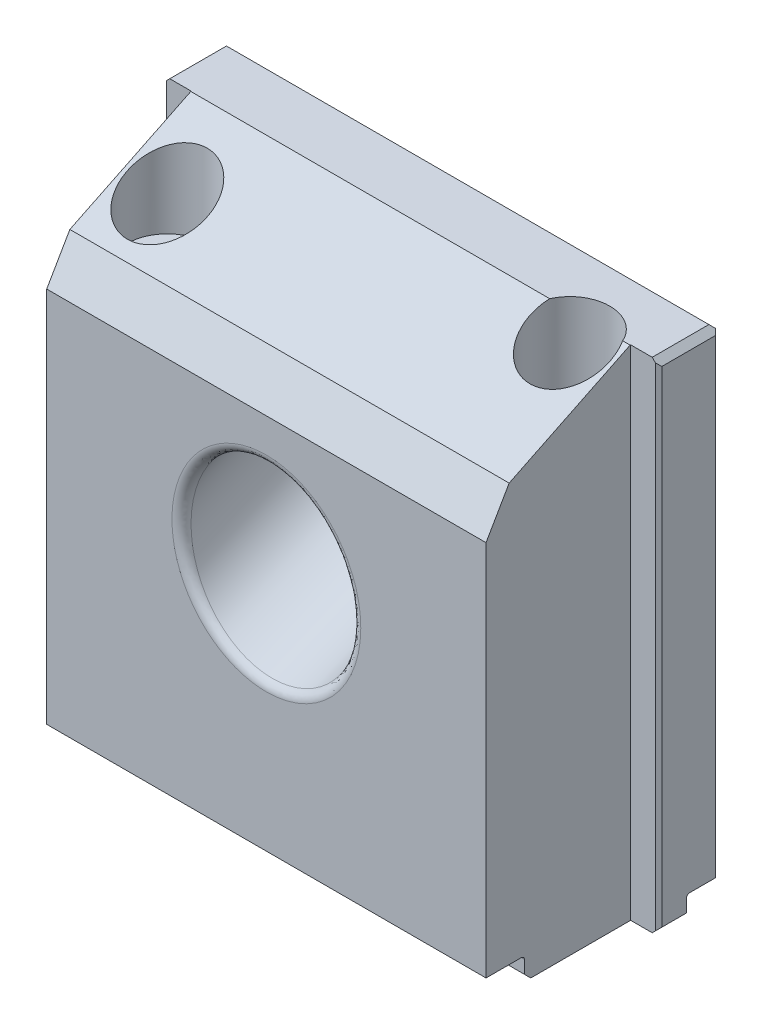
ISO-10303-21;
HEADER;
FILE_DESCRIPTION(('STEP AP214'),'2;1');
FILE_NAME('part.step','',(''),(''),'','','');
FILE_SCHEMA(('AUTOMOTIVE_DESIGN { 1 0 10303 214 1 1 1 1 }'));
ENDSEC;
DATA;
#1=APPLICATION_CONTEXT('core data for automotive mechanical design processes');
#2=APPLICATION_PROTOCOL_DEFINITION('international standard','automotive_design',2000,#1);
#3=PRODUCT_CONTEXT('',#1,'mechanical');
#4=PRODUCT('Part','Part','',(#3));
#5=PRODUCT_RELATED_PRODUCT_CATEGORY('part','',(#4));
#6=PRODUCT_DEFINITION_FORMATION('','',#4);
#7=PRODUCT_DEFINITION_CONTEXT('part definition',#1,'design');
#8=PRODUCT_DEFINITION('design','',#6,#7);
#9=PRODUCT_DEFINITION_SHAPE('','',#8);
#10=(LENGTH_UNIT() NAMED_UNIT(*) SI_UNIT(.MILLI.,.METRE.));
#11=(NAMED_UNIT(*) PLANE_ANGLE_UNIT() SI_UNIT($,.RADIAN.));
#12=(NAMED_UNIT(*) SI_UNIT($,.STERADIAN.) SOLID_ANGLE_UNIT());
#13=UNCERTAINTY_MEASURE_WITH_UNIT(LENGTH_MEASURE(1.E-05),#10,'distance_accuracy_value','');
#14=(GEOMETRIC_REPRESENTATION_CONTEXT(3) GLOBAL_UNCERTAINTY_ASSIGNED_CONTEXT((#13)) GLOBAL_UNIT_ASSIGNED_CONTEXT((#10,
#11,#12)) REPRESENTATION_CONTEXT('',''));
#15=CARTESIAN_POINT('',(0.,0.,0.));
#16=DIRECTION('',(0.,0.,1.));
#17=DIRECTION('',(1.,0.,0.));
#18=AXIS2_PLACEMENT_3D('',#15,#16,#17);
#19=CARTESIAN_POINT('',(-10.541,11.43,-8.636));
#20=DIRECTION('',(0.,0.,1.));
#21=DIRECTION('',(1.,0.,0.));
#22=AXIS2_PLACEMENT_3D('',#19,#20,#21);
#23=PLANE('',#22);
#24=CARTESIAN_POINT('',(-10.541,11.43,-8.636));
#25=DIRECTION('',(0.,0.,1.));
#26=DIRECTION('',(1.,0.,0.));
#27=AXIS2_PLACEMENT_3D('',#24,#25,#26);
#28=CIRCLE('',#27,6.35);
#29=CARTESIAN_POINT('',(-4.191,11.43,-8.636));
#30=VERTEX_POINT('',#29);
#31=EDGE_CURVE('E612',#30,#30,#28,.T.);
#32=ORIENTED_EDGE('',*,*,#31,.F.);
#33=EDGE_LOOP('',(#32));
#34=FACE_BOUND('',#33,.T.);
#35=CARTESIAN_POINT('',(-10.541,15.24,-8.636));
#36=DIRECTION('',(0.,0.,1.));
#37=DIRECTION('',(1.,0.,0.));
#38=AXIS2_PLACEMENT_3D('',#35,#36,#37);
#39=CIRCLE('',#38,0.889);
#40=CARTESIAN_POINT('',(-9.652,15.24,-8.636));
#41=VERTEX_POINT('',#40);
#42=EDGE_CURVE('E362',#41,#41,#39,.T.);
#43=ORIENTED_EDGE('',*,*,#42,.T.);
#44=EDGE_LOOP('',(#43));
#45=FACE_BOUND('',#44,.T.);
#46=DIRECTION('',(-0.999999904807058,-0.000436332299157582,0.));
#47=VECTOR('',#46,1.);
#48=CARTESIAN_POINT('',(-11.6331998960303,15.2395234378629,-8.636));
#49=LINE('',#48,#47);
#50=CARTESIAN_POINT('',(-11.6334538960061,15.2395233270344,-8.636));
#51=VERTEX_POINT('',#50);
#52=CARTESIAN_POINT('',(-11.6331998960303,15.2395234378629,-8.636));
#53=VERTEX_POINT('',#52);
#54=EDGE_CURVE('E299',#51,#53,#49,.F.);
#55=ORIENTED_EDGE('',*,*,#54,.F.);
#56=CARTESIAN_POINT('',(-10.541,15.24,-8.636));
#57=DIRECTION('',(0.,0.,-1.));
#58=DIRECTION('',(-1.,0.,0.));
#59=AXIS2_PLACEMENT_3D('',#56,#57,#58);
#60=CIRCLE('',#59,1.092454);
#61=CARTESIAN_POINT('',(-11.633454,15.24,-8.636));
#62=VERTEX_POINT('',#61);
#63=EDGE_CURVE('E1348',#62,#51,#60,.T.);
#64=ORIENTED_EDGE('',*,*,#63,.F.);
#65=DIRECTION('',(-1.,0.,0.));
#66=VECTOR('',#65,1.);
#67=CARTESIAN_POINT('',(-11.6332,15.24,-8.636));
#68=LINE('',#67,#66);
#69=CARTESIAN_POINT('',(-11.6332,15.24,-8.636));
#70=VERTEX_POINT('',#69);
#71=EDGE_CURVE('E31',#62,#70,#68,.F.);
#72=ORIENTED_EDGE('',*,*,#71,.T.);
#73=CARTESIAN_POINT('',(-10.541,15.24,-8.636));
#74=DIRECTION('',(0.,0.,-1.));
#75=DIRECTION('',(-1.,0.,0.));
#76=AXIS2_PLACEMENT_3D('',#73,#74,#75);
#77=CIRCLE('',#76,1.0922);
#78=EDGE_CURVE('E1361',#70,#53,#77,.T.);
#79=ORIENTED_EDGE('',*,*,#78,.T.);
#80=EDGE_LOOP('',(#55,#64,#72,#79));
#81=FACE_BOUND('',#80,.T.);
#82=ADVANCED_FACE('F16',(#34,#45,#81),#23,.F.);
#83=CARTESIAN_POINT('',(-19.685,37.846,-16.256));
#84=DIRECTION('',(0.,0.,-1.));
#85=DIRECTION('',(-1.,0.,0.));
#86=AXIS2_PLACEMENT_3D('',#83,#84,#85);
#87=PLANE('',#86);
#88=DIRECTION('',(0.,1.,0.));
#89=VECTOR('',#88,1.);
#90=CARTESIAN_POINT('',(-19.431,37.846,-16.256));
#91=LINE('',#90,#89);
#92=CARTESIAN_POINT('',(-19.431,1.778,-16.256));
#93=VERTEX_POINT('',#92);
#94=CARTESIAN_POINT('',(-19.431,39.37,-16.256));
#95=VERTEX_POINT('',#94);
#96=EDGE_CURVE('E417',#93,#95,#91,.T.);
#97=ORIENTED_EDGE('',*,*,#96,.T.);
#98=DIRECTION('',(1.,0.,0.));
#99=VECTOR('',#98,1.);
#100=CARTESIAN_POINT('',(-9.525,39.37,-16.256));
#101=LINE('',#100,#99);
#102=CARTESIAN_POINT('',(-9.525,39.37,-16.256));
#103=VERTEX_POINT('',#102);
#104=EDGE_CURVE('E472',#95,#103,#101,.T.);
#105=ORIENTED_EDGE('',*,*,#104,.T.);
#106=DIRECTION('',(0.,-1.,0.));
#107=VECTOR('',#106,1.);
#108=CARTESIAN_POINT('',(-9.525,19.812,-16.256));
#109=LINE('',#108,#107);
#110=CARTESIAN_POINT('',(-9.525,17.6981930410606,-16.256));
#111=VERTEX_POINT('',#110);
#112=EDGE_CURVE('E308',#103,#111,#109,.T.);
#113=ORIENTED_EDGE('',*,*,#112,.T.);
#114=CARTESIAN_POINT('',(-10.541,11.43,-16.256));
#115=DIRECTION('',(0.,0.,-1.));
#116=DIRECTION('',(-1.,0.,0.));
#117=AXIS2_PLACEMENT_3D('',#114,#115,#116);
#118=CIRCLE('',#117,6.35);
#119=CARTESIAN_POINT('',(-9.525,5.16180695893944,-16.256));
#120=VERTEX_POINT('',#119);
#121=EDGE_CURVE('E608',#120,#111,#118,.T.);
#122=ORIENTED_EDGE('',*,*,#121,.F.);
#123=DIRECTION('',(0.,1.,0.));
#124=VECTOR('',#123,1.);
#125=CARTESIAN_POINT('',(-9.525,37.846,-16.256));
#126=LINE('',#125,#124);
#127=CARTESIAN_POINT('',(-9.525,1.778,-16.256));
#128=VERTEX_POINT('',#127);
#129=EDGE_CURVE('E385',#128,#120,#126,.T.);
#130=ORIENTED_EDGE('',*,*,#129,.F.);
#131=DIRECTION('',(-1.,0.,0.));
#132=VECTOR('',#131,1.);
#133=CARTESIAN_POINT('',(120.675342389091,1.778,-16.256));
#134=LINE('',#133,#132);
#135=EDGE_CURVE('E708',#128,#93,#134,.T.);
#136=ORIENTED_EDGE('',*,*,#135,.T.);
#137=EDGE_LOOP('',(#97,#105,#113,#122,#130,#136));
#138=FACE_BOUND('',#137,.T.);
#139=ADVANCED_FACE('F636',(#138),#87,.T.);
#140=CARTESIAN_POINT('',(120.675342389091,1.778,0.));
#141=DIRECTION('',(0.,1.,0.));
#142=DIRECTION('',(0.,0.,1.));
#143=AXIS2_PLACEMENT_3D('',#140,#141,#142);
#144=PLANE('',#143);
#145=DIRECTION('',(0.,0.,-1.));
#146=VECTOR('',#145,1.);
#147=CARTESIAN_POINT('',(-17.4625,1.778,0.));
#148=LINE('',#147,#146);
#149=CARTESIAN_POINT('',(-17.4625,1.778,0.));
#150=VERTEX_POINT('',#149);
#151=CARTESIAN_POINT('',(-17.4625,1.778,-2.794));
#152=VERTEX_POINT('',#151);
#153=EDGE_CURVE('E776',#150,#152,#148,.T.);
#154=ORIENTED_EDGE('',*,*,#153,.T.);
#155=DIRECTION('',(-1.,0.,0.));
#156=VECTOR('',#155,1.);
#157=CARTESIAN_POINT('',(17.4625,1.778,-2.794));
#158=LINE('',#157,#156);
#159=CARTESIAN_POINT('',(17.4625,1.778,-2.794));
#160=VERTEX_POINT('',#159);
#161=EDGE_CURVE('E490',#152,#160,#158,.F.);
#162=ORIENTED_EDGE('',*,*,#161,.T.);
#163=DIRECTION('',(0.,0.,1.));
#164=VECTOR('',#163,1.);
#165=CARTESIAN_POINT('',(17.4625,1.778,-11.49604));
#166=LINE('',#165,#164);
#167=CARTESIAN_POINT('',(17.4625,1.778,0.));
#168=VERTEX_POINT('',#167);
#169=EDGE_CURVE('E779',#160,#168,#166,.T.);
#170=ORIENTED_EDGE('',*,*,#169,.T.);
#171=DIRECTION('',(-1.,0.,0.));
#172=VECTOR('',#171,1.);
#173=CARTESIAN_POINT('',(120.675342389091,1.778,0.));
#174=LINE('',#173,#172);
#175=EDGE_CURVE('E611',#168,#150,#174,.T.);
#176=ORIENTED_EDGE('',*,*,#175,.T.);
#177=EDGE_LOOP('',(#154,#162,#170,#176));
#178=FACE_BOUND('',#177,.T.);
#179=ADVANCED_FACE('F642',(#178),#144,.F.);
#180=CARTESIAN_POINT('',(120.675342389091,1.778,-3.048));
#181=DIRECTION('',(0.,0.,-1.));
#182=DIRECTION('',(-1.,0.,0.));
#183=AXIS2_PLACEMENT_3D('',#180,#181,#182);
#184=PLANE('',#183);
#185=DIRECTION('',(0.,-1.,0.));
#186=VECTOR('',#185,1.);
#187=CARTESIAN_POINT('',(-17.4625,37.846,-3.048));
#188=LINE('',#187,#186);
#189=CARTESIAN_POINT('',(-17.4625,1.524,-3.048));
#190=VERTEX_POINT('',#189);
#191=CARTESIAN_POINT('',(-17.4625,0.508,-3.048));
#192=VERTEX_POINT('',#191);
#193=EDGE_CURVE('E601',#190,#192,#188,.T.);
#194=ORIENTED_EDGE('',*,*,#193,.T.);
#195=DIRECTION('',(1.,0.,0.));
#196=VECTOR('',#195,1.);
#197=CARTESIAN_POINT('',(120.675342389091,0.508000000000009,-3.048));
#198=LINE('',#197,#196);
#199=CARTESIAN_POINT('',(17.4625,0.508000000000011,-3.048));
#200=VERTEX_POINT('',#199);
#201=EDGE_CURVE('E39',#192,#200,#198,.T.);
#202=ORIENTED_EDGE('',*,*,#201,.T.);
#203=DIRECTION('',(0.,1.,0.));
#204=VECTOR('',#203,1.);
#205=CARTESIAN_POINT('',(17.4625,37.846,-3.048));
#206=LINE('',#205,#204);
#207=CARTESIAN_POINT('',(17.4625,1.524,-3.048));
#208=VERTEX_POINT('',#207);
#209=EDGE_CURVE('E781',#200,#208,#206,.T.);
#210=ORIENTED_EDGE('',*,*,#209,.T.);
#211=DIRECTION('',(-1.,0.,0.));
#212=VECTOR('',#211,1.);
#213=CARTESIAN_POINT('',(-17.4625,1.524,-3.048));
#214=LINE('',#213,#212);
#215=EDGE_CURVE('E487',#208,#190,#214,.T.);
#216=ORIENTED_EDGE('',*,*,#215,.T.);
#217=EDGE_LOOP('',(#194,#202,#210,#216));
#218=FACE_BOUND('',#217,.T.);
#219=ADVANCED_FACE('F658',(#218),#184,.F.);
#220=CARTESIAN_POINT('',(-19.685,37.846,-11.49604));
#221=DIRECTION('',(-1.,0.,0.));
#222=DIRECTION('',(0.,0.,1.));
#223=AXIS2_PLACEMENT_3D('',#220,#221,#222);
#224=PLANE('',#223);
#225=DIRECTION('',(0.,1.,0.));
#226=VECTOR('',#225,1.);
#227=CARTESIAN_POINT('',(-19.685,37.846,-13.716));
#228=LINE('',#227,#226);
#229=CARTESIAN_POINT('',(-19.685,0.508,-13.716));
#230=VERTEX_POINT('',#229);
#231=CARTESIAN_POINT('',(-19.685,1.524,-13.716));
#232=VERTEX_POINT('',#231);
#233=EDGE_CURVE('E545',#230,#232,#228,.T.);
#234=ORIENTED_EDGE('',*,*,#233,.F.);
#235=DIRECTION('',(0.,0.,1.));
#236=VECTOR('',#235,1.);
#237=CARTESIAN_POINT('',(-19.685,0.508,-11.75004));
#238=LINE('',#237,#236);
#239=CARTESIAN_POINT('',(-19.685,0.508,-11.75004));
#240=VERTEX_POINT('',#239);
#241=EDGE_CURVE('E430',#230,#240,#238,.T.);
#242=ORIENTED_EDGE('',*,*,#241,.T.);
#243=DIRECTION('',(0.,1.,0.));
#244=VECTOR('',#243,1.);
#245=CARTESIAN_POINT('',(-19.685,37.846,-11.75004));
#246=LINE('',#245,#244);
#247=CARTESIAN_POINT('',(-19.685,39.116,-11.75004));
#248=VERTEX_POINT('',#247);
#249=EDGE_CURVE('E411',#240,#248,#246,.T.);
#250=ORIENTED_EDGE('',*,*,#249,.T.);
#251=DIRECTION('',(0.,0.,-1.));
#252=VECTOR('',#251,1.);
#253=CARTESIAN_POINT('',(-19.685,39.116,-16.002));
#254=LINE('',#253,#252);
#255=CARTESIAN_POINT('',(-19.685,39.116,-16.002));
#256=VERTEX_POINT('',#255);
#257=EDGE_CURVE('E428',#248,#256,#254,.T.);
#258=ORIENTED_EDGE('',*,*,#257,.T.);
#259=DIRECTION('',(0.,-1.,0.));
#260=VECTOR('',#259,1.);
#261=CARTESIAN_POINT('',(-19.685,37.846,-16.002));
#262=LINE('',#261,#260);
#263=CARTESIAN_POINT('',(-19.685,1.778,-16.002));
#264=VERTEX_POINT('',#263);
#265=EDGE_CURVE('E414',#256,#264,#262,.T.);
#266=ORIENTED_EDGE('',*,*,#265,.T.);
#267=DIRECTION('',(0.,0.,-1.));
#268=VECTOR('',#267,1.);
#269=CARTESIAN_POINT('',(-19.685,1.778,-11.49604));
#270=LINE('',#269,#268);
#271=CARTESIAN_POINT('',(-19.685,1.778,-13.97));
#272=VERTEX_POINT('',#271);
#273=EDGE_CURVE('E546',#272,#264,#270,.T.);
#274=ORIENTED_EDGE('',*,*,#273,.F.);
#275=CARTESIAN_POINT('',(-19.685,1.524,-13.97));
#276=DIRECTION('',(-1.,0.,0.));
#277=DIRECTION('',(0.,0.,1.));
#278=AXIS2_PLACEMENT_3D('',#275,#276,#277);
#279=CIRCLE('',#278,0.254);
#280=EDGE_CURVE('E492',#272,#232,#279,.F.);
#281=ORIENTED_EDGE('',*,*,#280,.T.);
#282=EDGE_LOOP('',(#234,#242,#250,#258,#266,#274,#281));
#283=FACE_BOUND('',#282,.T.);
#284=ADVANCED_FACE('F661',(#283),#224,.T.);
#285=CARTESIAN_POINT('',(19.685,37.846,-16.256));
#286=DIRECTION('',(1.,0.,0.));
#287=DIRECTION('',(0.,0.,-1.));
#288=AXIS2_PLACEMENT_3D('',#285,#286,#287);
#289=PLANE('',#288);
#290=DIRECTION('',(0.,-1.,0.));
#291=VECTOR('',#290,1.);
#292=CARTESIAN_POINT('',(19.685,37.846,-11.75004));
#293=LINE('',#292,#291);
#294=CARTESIAN_POINT('',(19.685,39.116,-11.75004));
#295=VERTEX_POINT('',#294);
#296=CARTESIAN_POINT('',(19.685,0.508,-11.75004));
#297=VERTEX_POINT('',#296);
#298=EDGE_CURVE('E399',#295,#297,#293,.T.);
#299=ORIENTED_EDGE('',*,*,#298,.T.);
#300=DIRECTION('',(0.,0.,-1.));
#301=VECTOR('',#300,1.);
#302=CARTESIAN_POINT('',(19.685,0.508,-13.716));
#303=LINE('',#302,#301);
#304=CARTESIAN_POINT('',(19.685,0.508000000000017,-13.716));
#305=VERTEX_POINT('',#304);
#306=EDGE_CURVE('E451',#297,#305,#303,.T.);
#307=ORIENTED_EDGE('',*,*,#306,.T.);
#308=DIRECTION('',(0.,-1.,0.));
#309=VECTOR('',#308,1.);
#310=CARTESIAN_POINT('',(19.685,37.846,-13.716));
#311=LINE('',#310,#309);
#312=CARTESIAN_POINT('',(19.685,1.524,-13.716));
#313=VERTEX_POINT('',#312);
#314=EDGE_CURVE('E539',#313,#305,#311,.T.);
#315=ORIENTED_EDGE('',*,*,#314,.F.);
#316=CARTESIAN_POINT('',(19.685,1.524,-13.97));
#317=DIRECTION('',(1.,0.,0.));
#318=DIRECTION('',(0.,0.,-1.));
#319=AXIS2_PLACEMENT_3D('',#316,#317,#318);
#320=CIRCLE('',#319,0.254);
#321=CARTESIAN_POINT('',(19.685,1.778,-13.97));
#322=VERTEX_POINT('',#321);
#323=EDGE_CURVE('E494',#313,#322,#320,.F.);
#324=ORIENTED_EDGE('',*,*,#323,.T.);
#325=DIRECTION('',(0.,0.,1.));
#326=VECTOR('',#325,1.);
#327=CARTESIAN_POINT('',(19.685,1.778,-16.256));
#328=LINE('',#327,#326);
#329=CARTESIAN_POINT('',(19.685,1.778,-16.002));
#330=VERTEX_POINT('',#329);
#331=EDGE_CURVE('E573',#330,#322,#328,.T.);
#332=ORIENTED_EDGE('',*,*,#331,.F.);
#333=DIRECTION('',(0.,1.,0.));
#334=VECTOR('',#333,1.);
#335=CARTESIAN_POINT('',(19.685,37.846,-16.002));
#336=LINE('',#335,#334);
#337=CARTESIAN_POINT('',(19.685,39.116,-16.002));
#338=VERTEX_POINT('',#337);
#339=EDGE_CURVE('E396',#330,#338,#336,.T.);
#340=ORIENTED_EDGE('',*,*,#339,.T.);
#341=DIRECTION('',(0.,0.,1.));
#342=VECTOR('',#341,1.);
#343=CARTESIAN_POINT('',(19.685,39.116,-11.75004));
#344=LINE('',#343,#342);
#345=EDGE_CURVE('E449',#338,#295,#344,.T.);
#346=ORIENTED_EDGE('',*,*,#345,.T.);
#347=EDGE_LOOP('',(#299,#307,#315,#324,#332,#340,#346));
#348=FACE_BOUND('',#347,.T.);
#349=ADVANCED_FACE('F548',(#348),#289,.T.);
#350=CARTESIAN_POINT('',(17.4625,0.,-16.256));
#351=DIRECTION('',(0.,1.,0.));
#352=DIRECTION('',(-1.,0.,0.));
#353=AXIS2_PLACEMENT_3D('',#350,#351,#352);
#354=PLANE('',#353);
#355=DIRECTION('',(0.,0.,1.));
#356=VECTOR('',#355,1.);
#357=CARTESIAN_POINT('',(17.4625,0.,-11.49604));
#358=LINE('',#357,#356);
#359=CARTESIAN_POINT('',(17.4625,0.,-11.49604));
#360=VERTEX_POINT('',#359);
#361=CARTESIAN_POINT('',(17.4625,0.,-3.556));
#362=VERTEX_POINT('',#361);
#363=EDGE_CURVE('E583',#360,#362,#358,.T.);
#364=ORIENTED_EDGE('',*,*,#363,.T.);
#365=DIRECTION('',(-1.,0.,0.));
#366=VECTOR('',#365,1.);
#367=CARTESIAN_POINT('',(17.4625,0.,-3.556));
#368=LINE('',#367,#366);
#369=CARTESIAN_POINT('',(-17.4625,0.,-3.556));
#370=VERTEX_POINT('',#369);
#371=EDGE_CURVE('E503',#362,#370,#368,.T.);
#372=ORIENTED_EDGE('',*,*,#371,.T.);
#373=DIRECTION('',(0.,0.,-1.));
#374=VECTOR('',#373,1.);
#375=CARTESIAN_POINT('',(-17.4625,0.,0.));
#376=LINE('',#375,#374);
#377=CARTESIAN_POINT('',(-17.4625,0.,-11.49604));
#378=VERTEX_POINT('',#377);
#379=EDGE_CURVE('E584',#370,#378,#376,.T.);
#380=ORIENTED_EDGE('',*,*,#379,.T.);
#381=DIRECTION('',(-1.,0.,0.));
#382=VECTOR('',#381,1.);
#383=CARTESIAN_POINT('',(-17.4625,0.,-11.49604));
#384=LINE('',#383,#382);
#385=CARTESIAN_POINT('',(-19.177,0.,-11.49604));
#386=VERTEX_POINT('',#385);
#387=EDGE_CURVE('E528',#378,#386,#384,.T.);
#388=ORIENTED_EDGE('',*,*,#387,.T.);
#389=DIRECTION('',(0.,0.,-1.));
#390=VECTOR('',#389,1.);
#391=CARTESIAN_POINT('',(-19.177,0.,-13.716));
#392=LINE('',#391,#390);
#393=CARTESIAN_POINT('',(-19.177,0.,-13.208));
#394=VERTEX_POINT('',#393);
#395=EDGE_CURVE('E425',#386,#394,#392,.T.);
#396=ORIENTED_EDGE('',*,*,#395,.T.);
#397=DIRECTION('',(1.,0.,0.));
#398=VECTOR('',#397,1.);
#399=CARTESIAN_POINT('',(17.4625,0.,-13.208));
#400=LINE('',#399,#398);
#401=CARTESIAN_POINT('',(19.177,0.,-13.208));
#402=VERTEX_POINT('',#401);
#403=EDGE_CURVE('E501',#394,#402,#400,.T.);
#404=ORIENTED_EDGE('',*,*,#403,.T.);
#405=DIRECTION('',(0.,0.,1.));
#406=VECTOR('',#405,1.);
#407=CARTESIAN_POINT('',(19.177,0.,-11.75004));
#408=LINE('',#407,#406);
#409=CARTESIAN_POINT('',(19.177,0.,-11.49604));
#410=VERTEX_POINT('',#409);
#411=EDGE_CURVE('E423',#402,#410,#408,.T.);
#412=ORIENTED_EDGE('',*,*,#411,.T.);
#413=DIRECTION('',(-1.,0.,0.));
#414=VECTOR('',#413,1.);
#415=CARTESIAN_POINT('',(19.685,0.,-11.49604));
#416=LINE('',#415,#414);
#417=EDGE_CURVE('E587',#410,#360,#416,.T.);
#418=ORIENTED_EDGE('',*,*,#417,.T.);
#419=EDGE_LOOP('',(#364,#372,#380,#388,#396,#404,#412,#418));
#420=FACE_BOUND('',#419,.T.);
#421=CARTESIAN_POINT('',(-13.97,0.,-6.096));
#422=DIRECTION('',(0.,1.,0.));
#423=DIRECTION('',(-1.,0.,0.));
#424=AXIS2_PLACEMENT_3D('',#421,#422,#423);
#425=CIRCLE('',#424,2.0447);
#426=CARTESIAN_POINT('',(-16.0147,0.,-6.096));
#427=VERTEX_POINT('',#426);
#428=EDGE_CURVE('E363',#427,#427,#425,.F.);
#429=ORIENTED_EDGE('',*,*,#428,.F.);
#430=EDGE_LOOP('',(#429));
#431=FACE_BOUND('',#430,.T.);
#432=CARTESIAN_POINT('',(13.97,0.,-10.16));
#433=DIRECTION('',(0.,1.,0.));
#434=DIRECTION('',(-1.,0.,0.));
#435=AXIS2_PLACEMENT_3D('',#432,#433,#434);
#436=CIRCLE('',#435,2.0447);
#437=CARTESIAN_POINT('',(11.9253,0.,-10.16));
#438=VERTEX_POINT('',#437);
#439=EDGE_CURVE('E359',#438,#438,#436,.F.);
#440=ORIENTED_EDGE('',*,*,#439,.F.);
#441=EDGE_LOOP('',(#440));
#442=FACE_BOUND('',#441,.T.);
#443=ADVANCED_FACE('F524',(#420,#431,#442),#354,.F.);
#444=CARTESIAN_POINT('',(-17.4625,37.846,-11.49604));
#445=DIRECTION('',(0.,0.,1.));
#446=DIRECTION('',(1.,0.,0.));
#447=AXIS2_PLACEMENT_3D('',#444,#445,#446);
#448=PLANE('',#447);
#449=DIRECTION('',(0.,-1.,0.));
#450=VECTOR('',#449,1.);
#451=CARTESIAN_POINT('',(-19.431,37.846,-11.49604));
#452=LINE('',#451,#450);
#453=CARTESIAN_POINT('',(-19.431,39.37,-11.49604));
#454=VERTEX_POINT('',#453);
#455=CARTESIAN_POINT('',(-19.431,0.254,-11.49604));
#456=VERTEX_POINT('',#455);
#457=EDGE_CURVE('E420',#454,#456,#452,.T.);
#458=ORIENTED_EDGE('',*,*,#457,.T.);
#459=DIRECTION('',(0.707106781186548,-0.707106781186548,0.));
#460=VECTOR('',#459,1.);
#461=CARTESIAN_POINT('',(-37.24275,18.06575,-11.49604));
#462=LINE('',#461,#460);
#463=EDGE_CURVE('E438',#456,#386,#462,.T.);
#464=ORIENTED_EDGE('',*,*,#463,.T.);
#465=ORIENTED_EDGE('',*,*,#387,.F.);
#466=DIRECTION('',(0.,-1.,0.));
#467=VECTOR('',#466,1.);
#468=CARTESIAN_POINT('',(-17.4625,37.846,-11.49604));
#469=LINE('',#468,#467);
#470=CARTESIAN_POINT('',(-17.4625,39.624,-11.49604));
#471=VERTEX_POINT('',#470);
#472=EDGE_CURVE('E593',#471,#378,#469,.T.);
#473=ORIENTED_EDGE('',*,*,#472,.F.);
#474=DIRECTION('',(1.,0.,0.));
#475=VECTOR('',#474,1.);
#476=CARTESIAN_POINT('',(-17.4625,39.624,-11.49604));
#477=LINE('',#476,#475);
#478=CARTESIAN_POINT('',(-19.177,39.624,-11.49604));
#479=VERTEX_POINT('',#478);
#480=EDGE_CURVE('E577',#479,#471,#477,.T.);
#481=ORIENTED_EDGE('',*,*,#480,.F.);
#482=DIRECTION('',(-0.707106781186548,-0.707106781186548,0.));
#483=VECTOR('',#482,1.);
#484=CARTESIAN_POINT('',(-19.20875,39.59225,-11.49604));
#485=LINE('',#484,#483);
#486=EDGE_CURVE('E436',#479,#454,#485,.T.);
#487=ORIENTED_EDGE('',*,*,#486,.T.);
#488=EDGE_LOOP('',(#458,#464,#465,#473,#481,#487));
#489=FACE_BOUND('',#488,.T.);
#490=ADVANCED_FACE('F672',(#489),#448,.T.);
#491=DIRECTION('',(0.,-1.,0.));
#492=VECTOR('',#491,1.);
#493=CARTESIAN_POINT('',(9.525,19.812,-16.256));
#494=LINE('',#493,#492);
#495=CARTESIAN_POINT('',(9.525,39.37,-16.256));
#496=VERTEX_POINT('',#495);
#497=CARTESIAN_POINT('',(9.525,1.778,-16.256));
#498=VERTEX_POINT('',#497);
#499=EDGE_CURVE('E735',#496,#498,#494,.T.);
#500=ORIENTED_EDGE('',*,*,#499,.F.);
#501=DIRECTION('',(1.,0.,0.));
#502=VECTOR('',#501,1.);
#503=CARTESIAN_POINT('',(19.177,39.37,-16.256));
#504=LINE('',#503,#502);
#505=CARTESIAN_POINT('',(19.431,39.37,-16.256));
#506=VERTEX_POINT('',#505);
#507=EDGE_CURVE('E478',#496,#506,#504,.T.);
#508=ORIENTED_EDGE('',*,*,#507,.T.);
#509=DIRECTION('',(0.,-1.,0.));
#510=VECTOR('',#509,1.);
#511=CARTESIAN_POINT('',(19.431,37.846,-16.256));
#512=LINE('',#511,#510);
#513=CARTESIAN_POINT('',(19.431,1.778,-16.256));
#514=VERTEX_POINT('',#513);
#515=EDGE_CURVE('E405',#506,#514,#512,.T.);
#516=ORIENTED_EDGE('',*,*,#515,.T.);
#517=EDGE_CURVE('E739',#514,#498,#134,.T.);
#518=ORIENTED_EDGE('',*,*,#517,.T.);
#519=EDGE_LOOP('',(#500,#508,#516,#518));
#520=FACE_BOUND('',#519,.T.);
#521=ADVANCED_FACE('F645',(#520),#87,.T.);
#522=CARTESIAN_POINT('',(19.685,37.846,-11.49604));
#523=DIRECTION('',(0.,0.,1.));
#524=DIRECTION('',(1.,0.,0.));
#525=AXIS2_PLACEMENT_3D('',#522,#523,#524);
#526=PLANE('',#525);
#527=ORIENTED_EDGE('',*,*,#417,.F.);
#528=DIRECTION('',(0.70710678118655,0.707106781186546,0.));
#529=VECTOR('',#528,1.);
#530=CARTESIAN_POINT('',(38.354,19.177,-11.49604));
#531=LINE('',#530,#529);
#532=CARTESIAN_POINT('',(19.431,0.254,-11.49604));
#533=VERTEX_POINT('',#532);
#534=EDGE_CURVE('E443',#410,#533,#531,.T.);
#535=ORIENTED_EDGE('',*,*,#534,.T.);
#536=DIRECTION('',(0.,1.,0.));
#537=VECTOR('',#536,1.);
#538=CARTESIAN_POINT('',(19.431,37.846,-11.49604));
#539=LINE('',#538,#537);
#540=CARTESIAN_POINT('',(19.431,39.37,-11.49604));
#541=VERTEX_POINT('',#540);
#542=EDGE_CURVE('E402',#533,#541,#539,.T.);
#543=ORIENTED_EDGE('',*,*,#542,.T.);
#544=DIRECTION('',(-0.707106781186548,0.707106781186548,0.));
#545=VECTOR('',#544,1.);
#546=CARTESIAN_POINT('',(20.32,38.481,-11.49604));
#547=LINE('',#546,#545);
#548=CARTESIAN_POINT('',(19.177,39.624,-11.49604));
#549=VERTEX_POINT('',#548);
#550=EDGE_CURVE('E441',#541,#549,#547,.T.);
#551=ORIENTED_EDGE('',*,*,#550,.T.);
#552=DIRECTION('',(1.,0.,0.));
#553=VECTOR('',#552,1.);
#554=CARTESIAN_POINT('',(19.685,39.624,-11.49604));
#555=LINE('',#554,#553);
#556=CARTESIAN_POINT('',(17.4625,39.624,-11.49604));
#557=VERTEX_POINT('',#556);
#558=EDGE_CURVE('E565',#557,#549,#555,.T.);
#559=ORIENTED_EDGE('',*,*,#558,.F.);
#560=DIRECTION('',(0.,-1.,0.));
#561=VECTOR('',#560,1.);
#562=CARTESIAN_POINT('',(17.4625,37.846,-11.49604));
#563=LINE('',#562,#561);
#564=EDGE_CURVE('E590',#557,#360,#563,.T.);
#565=ORIENTED_EDGE('',*,*,#564,.T.);
#566=EDGE_LOOP('',(#527,#535,#543,#551,#559,#565));
#567=FACE_BOUND('',#566,.T.);
#568=ADVANCED_FACE('F563',(#567),#526,.T.);
#569=CARTESIAN_POINT('',(17.4625,37.846,-11.49604));
#570=DIRECTION('',(1.,0.,0.));
#571=DIRECTION('',(0.,0.,-1.));
#572=AXIS2_PLACEMENT_3D('',#569,#570,#571);
#573=PLANE('',#572);
#574=ORIENTED_EDGE('',*,*,#209,.F.);
#575=DIRECTION('',(0.,0.707106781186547,0.707106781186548));
#576=VECTOR('',#575,1.);
#577=CARTESIAN_POINT('',(17.4625,14.95298,11.39698));
#578=LINE('',#577,#576);
#579=EDGE_CURVE('E509',#200,#362,#578,.F.);
#580=ORIENTED_EDGE('',*,*,#579,.T.);
#581=ORIENTED_EDGE('',*,*,#363,.F.);
#582=ORIENTED_EDGE('',*,*,#564,.F.);
#583=DIRECTION('',(0.,0.,-1.));
#584=VECTOR('',#583,1.);
#585=CARTESIAN_POINT('',(17.4625,39.624,-11.49604));
#586=LINE('',#585,#584);
#587=CARTESIAN_POINT('',(17.4625,39.624,-11.4551754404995));
#588=VERTEX_POINT('',#587);
#589=EDGE_CURVE('E572',#588,#557,#586,.T.);
#590=ORIENTED_EDGE('',*,*,#589,.F.);
#591=DIRECTION('',(0.,0.438371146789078,-0.898794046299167));
#592=VECTOR('',#591,1.);
#593=CARTESIAN_POINT('',(17.4625,39.2984239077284,-10.7876455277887));
#594=LINE('',#593,#592);
#595=CARTESIAN_POINT('',(17.4625,34.9333433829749,-1.83790415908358));
#596=VERTEX_POINT('',#595);
#597=EDGE_CURVE('E783',#596,#588,#594,.T.);
#598=ORIENTED_EDGE('',*,*,#597,.F.);
#599=DIRECTION('',(0.,0.866025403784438,-0.5));
#600=VECTOR('',#599,1.);
#601=CARTESIAN_POINT('',(17.4625,41.2999313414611,-5.51365543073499));
#602=LINE('',#601,#600);
#603=CARTESIAN_POINT('',(17.4625,31.75,0.));
#604=VERTEX_POINT('',#603);
#605=EDGE_CURVE('E373',#604,#596,#602,.T.);
#606=ORIENTED_EDGE('',*,*,#605,.F.);
#607=DIRECTION('',(0.,-1.,0.));
#608=VECTOR('',#607,1.);
#609=CARTESIAN_POINT('',(17.4625,37.846,0.));
#610=LINE('',#609,#608);
#611=EDGE_CURVE('E598',#604,#168,#610,.T.);
#612=ORIENTED_EDGE('',*,*,#611,.T.);
#613=ORIENTED_EDGE('',*,*,#169,.F.);
#614=CARTESIAN_POINT('',(17.4625,1.524,-2.794));
#615=DIRECTION('',(1.,0.,0.));
#616=DIRECTION('',(0.,0.,-1.));
#617=AXIS2_PLACEMENT_3D('',#614,#615,#616);
#618=CIRCLE('',#617,0.254);
#619=EDGE_CURVE('E498',#160,#208,#618,.F.);
#620=ORIENTED_EDGE('',*,*,#619,.T.);
#621=EDGE_LOOP('',(#574,#580,#581,#582,#590,#598,#606,#612,#613,#620));
#622=FACE_BOUND('',#621,.T.);
#623=ADVANCED_FACE('F632',(#622),#573,.T.);
#624=CARTESIAN_POINT('',(-17.4625,37.846,0.));
#625=DIRECTION('',(-1.,0.,0.));
#626=DIRECTION('',(0.,0.,1.));
#627=AXIS2_PLACEMENT_3D('',#624,#625,#626);
#628=PLANE('',#627);
#629=ORIENTED_EDGE('',*,*,#379,.F.);
#630=DIRECTION('',(0.,-0.707106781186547,-0.707106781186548));
#631=VECTOR('',#630,1.);
#632=CARTESIAN_POINT('',(-17.4625,20.701,17.145));
#633=LINE('',#632,#631);
#634=EDGE_CURVE('E506',#370,#192,#633,.F.);
#635=ORIENTED_EDGE('',*,*,#634,.T.);
#636=ORIENTED_EDGE('',*,*,#193,.F.);
#637=CARTESIAN_POINT('',(-17.4625,1.524,-2.794));
#638=DIRECTION('',(-1.,0.,0.));
#639=DIRECTION('',(0.,0.,1.));
#640=AXIS2_PLACEMENT_3D('',#637,#638,#639);
#641=CIRCLE('',#640,0.254);
#642=EDGE_CURVE('E496',#190,#152,#641,.F.);
#643=ORIENTED_EDGE('',*,*,#642,.T.);
#644=ORIENTED_EDGE('',*,*,#153,.F.);
#645=DIRECTION('',(0.,-1.,0.));
#646=VECTOR('',#645,1.);
#647=CARTESIAN_POINT('',(-17.4625,37.846,0.));
#648=LINE('',#647,#646);
#649=CARTESIAN_POINT('',(-17.4625,31.75,0.));
#650=VERTEX_POINT('',#649);
#651=EDGE_CURVE('E596',#650,#150,#648,.T.);
#652=ORIENTED_EDGE('',*,*,#651,.F.);
#653=DIRECTION('',(0.,0.866025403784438,-0.5));
#654=VECTOR('',#653,1.);
#655=CARTESIAN_POINT('',(-17.4625,31.75,0.));
#656=LINE('',#655,#654);
#657=CARTESIAN_POINT('',(-17.4625,34.9333433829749,-1.83790415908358));
#658=VERTEX_POINT('',#657);
#659=EDGE_CURVE('E759',#650,#658,#656,.T.);
#660=ORIENTED_EDGE('',*,*,#659,.T.);
#661=DIRECTION('',(0.,-0.438371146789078,0.898794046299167));
#662=VECTOR('',#661,1.);
#663=CARTESIAN_POINT('',(-17.4625,34.7689223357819,-1.5007910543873));
#664=LINE('',#663,#662);
#665=CARTESIAN_POINT('',(-17.4625,39.624,-11.4551754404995));
#666=VERTEX_POINT('',#665);
#667=EDGE_CURVE('E603',#666,#658,#664,.T.);
#668=ORIENTED_EDGE('',*,*,#667,.F.);
#669=DIRECTION('',(0.,0.,1.));
#670=VECTOR('',#669,1.);
#671=CARTESIAN_POINT('',(-17.4625,39.624,0.));
#672=LINE('',#671,#670);
#673=EDGE_CURVE('E382',#471,#666,#672,.T.);
#674=ORIENTED_EDGE('',*,*,#673,.F.);
#675=ORIENTED_EDGE('',*,*,#472,.T.);
#676=EDGE_LOOP('',(#629,#635,#636,#643,#644,#652,#660,#668,#674,#675));
#677=FACE_BOUND('',#676,.T.);
#678=ADVANCED_FACE('F623',(#677),#628,.T.);
#679=CARTESIAN_POINT('',(17.4625,37.846,0.));
#680=DIRECTION('',(0.,0.,1.));
#681=DIRECTION('',(1.,0.,0.));
#682=AXIS2_PLACEMENT_3D('',#679,#680,#681);
#683=PLANE('',#682);
#684=DIRECTION('',(1.,0.,0.));
#685=VECTOR('',#684,1.);
#686=CARTESIAN_POINT('',(-17.4625,31.75,0.));
#687=LINE('',#686,#685);
#688=EDGE_CURVE('E758',#650,#604,#687,.T.);
#689=ORIENTED_EDGE('',*,*,#688,.F.);
#690=ORIENTED_EDGE('',*,*,#651,.T.);
#691=ORIENTED_EDGE('',*,*,#175,.F.);
#692=ORIENTED_EDGE('',*,*,#611,.F.);
#693=EDGE_LOOP('',(#689,#690,#691,#692));
#694=FACE_BOUND('',#693,.T.);
#695=CARTESIAN_POINT('',(0.,20.8980560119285,0.));
#696=DIRECTION('',(0.,0.,1.));
#697=DIRECTION('',(0.,-1.,0.));
#698=AXIS2_PLACEMENT_3D('',#695,#696,#697);
#699=ELLIPSE('',#698,8.15389508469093,7.5057);
#700=CARTESIAN_POINT('',(0.,12.7441609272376,0.));
#701=VERTEX_POINT('',#700);
#702=EDGE_CURVE('E352',#701,#701,#699,.F.);
#703=ORIENTED_EDGE('',*,*,#702,.T.);
#704=EDGE_LOOP('',(#703));
#705=FACE_BOUND('',#704,.T.);
#706=ADVANCED_FACE('F346',(#694,#705),#683,.T.);
#707=CARTESIAN_POINT('',(120.675342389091,39.624,-11.4551754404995));
#708=DIRECTION('',(0.,-0.898794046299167,-0.438371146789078));
#709=DIRECTION('',(0.,0.438371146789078,-0.898794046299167));
#710=AXIS2_PLACEMENT_3D('',#707,#708,#709);
#711=PLANE('',#710);
#712=CARTESIAN_POINT('',(-13.97,37.0101554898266,-6.096));
#713=DIRECTION('',(0.,-0.898794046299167,-0.438371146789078));
#714=DIRECTION('',(0.,-0.438371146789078,0.898794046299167));
#715=AXIS2_PLACEMENT_3D('',#712,#713,#714);
#716=ELLIPSE('',#715,3.53251116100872,3.175);
#717=CARTESIAN_POINT('',(-13.97,35.46160452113,-2.921));
#718=VERTEX_POINT('',#717);
#719=EDGE_CURVE('E367',#718,#718,#716,.T.);
#720=ORIENTED_EDGE('',*,*,#719,.T.);
#721=EDGE_LOOP('',(#720));
#722=FACE_BOUND('',#721,.T.);
#723=ORIENTED_EDGE('',*,*,#667,.T.);
#724=DIRECTION('',(1.,0.,0.));
#725=VECTOR('',#724,1.);
#726=CARTESIAN_POINT('',(-17.4625,34.9333433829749,-1.83790415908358));
#727=LINE('',#726,#725);
#728=EDGE_CURVE('E762',#658,#596,#727,.T.);
#729=ORIENTED_EDGE('',*,*,#728,.T.);
#730=ORIENTED_EDGE('',*,*,#597,.T.);
#731=DIRECTION('',(-1.,0.,0.));
#732=VECTOR('',#731,1.);
#733=CARTESIAN_POINT('',(120.675342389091,39.624,-11.4551754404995));
#734=LINE('',#733,#732);
#735=CARTESIAN_POINT('',(16.868817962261,39.624,-11.4551754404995));
#736=VERTEX_POINT('',#735);
#737=EDGE_CURVE('E772',#588,#736,#734,.T.);
#738=ORIENTED_EDGE('',*,*,#737,.T.);
#739=CARTESIAN_POINT('',(13.97,38.9923007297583,-10.16));
#740=DIRECTION('',(0.,-0.898794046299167,-0.438371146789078));
#741=DIRECTION('',(0.,-0.438371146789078,0.898794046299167));
#742=AXIS2_PLACEMENT_3D('',#739,#740,#741);
#743=ELLIPSE('',#742,3.53251116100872,3.175);
#744=CARTESIAN_POINT('',(11.071182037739,39.624,-11.4551754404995));
#745=VERTEX_POINT('',#744);
#746=EDGE_CURVE('E357',#736,#745,#743,.T.);
#747=ORIENTED_EDGE('',*,*,#746,.T.);
#748=EDGE_CURVE('E771',#745,#666,#734,.T.);
#749=ORIENTED_EDGE('',*,*,#748,.T.);
#750=EDGE_LOOP('',(#723,#729,#730,#738,#747,#749));
#751=FACE_BOUND('',#750,.T.);
#752=ADVANCED_FACE('F622',(#722,#751),#711,.F.);
#753=CARTESIAN_POINT('',(120.675342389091,39.624,-16.256));
#754=DIRECTION('',(0.,-1.,0.));
#755=DIRECTION('',(0.,0.,-1.));
#756=AXIS2_PLACEMENT_3D('',#753,#754,#755);
#757=PLANE('',#756);
#758=DIRECTION('',(-1.,0.,0.));
#759=VECTOR('',#758,1.);
#760=CARTESIAN_POINT('',(120.675342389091,39.624,-16.002));
#761=LINE('',#760,#759);
#762=CARTESIAN_POINT('',(9.525,39.624,-16.002));
#763=VERTEX_POINT('',#762);
#764=CARTESIAN_POINT('',(-9.525,39.624,-16.002));
#765=VERTEX_POINT('',#764);
#766=EDGE_CURVE('E387',#763,#765,#761,.T.);
#767=ORIENTED_EDGE('',*,*,#766,.T.);
#768=DIRECTION('',(-1.,0.,0.));
#769=VECTOR('',#768,1.);
#770=CARTESIAN_POINT('',(-19.177,39.624,-16.002));
#771=LINE('',#770,#769);
#772=CARTESIAN_POINT('',(-19.177,39.624,-16.002));
#773=VERTEX_POINT('',#772);
#774=EDGE_CURVE('E467',#765,#773,#771,.T.);
#775=ORIENTED_EDGE('',*,*,#774,.T.);
#776=DIRECTION('',(0.,0.,1.));
#777=VECTOR('',#776,1.);
#778=CARTESIAN_POINT('',(-19.177,39.624,-11.75004));
#779=LINE('',#778,#777);
#780=EDGE_CURVE('E454',#773,#479,#779,.T.);
#781=ORIENTED_EDGE('',*,*,#780,.T.);
#782=ORIENTED_EDGE('',*,*,#480,.T.);
#783=ORIENTED_EDGE('',*,*,#673,.T.);
#784=ORIENTED_EDGE('',*,*,#748,.F.);
#785=CARTESIAN_POINT('',(13.97,39.624,-10.16));
#786=DIRECTION('',(0.,-1.,0.));
#787=DIRECTION('',(0.,0.,-1.));
#788=AXIS2_PLACEMENT_3D('',#785,#786,#787);
#789=CIRCLE('',#788,3.175);
#790=EDGE_CURVE('E378',#745,#736,#789,.T.);
#791=ORIENTED_EDGE('',*,*,#790,.T.);
#792=ORIENTED_EDGE('',*,*,#737,.F.);
#793=ORIENTED_EDGE('',*,*,#589,.T.);
#794=ORIENTED_EDGE('',*,*,#558,.T.);
#795=DIRECTION('',(0.,0.,-1.));
#796=VECTOR('',#795,1.);
#797=CARTESIAN_POINT('',(19.177,39.624,-16.002));
#798=LINE('',#797,#796);
#799=CARTESIAN_POINT('',(19.177,39.624,-16.002));
#800=VERTEX_POINT('',#799);
#801=EDGE_CURVE('E456',#549,#800,#798,.T.);
#802=ORIENTED_EDGE('',*,*,#801,.T.);
#803=DIRECTION('',(-1.,0.,0.));
#804=VECTOR('',#803,1.);
#805=CARTESIAN_POINT('',(9.525,39.624,-16.002));
#806=LINE('',#805,#804);
#807=EDGE_CURVE('E464',#800,#763,#806,.T.);
#808=ORIENTED_EDGE('',*,*,#807,.T.);
#809=EDGE_LOOP('',(#767,#775,#781,#782,#783,#784,#791,#792,#793,#794,#802,#808));
#810=FACE_BOUND('',#809,.T.);
#811=ADVANCED_FACE('F568',(#810),#757,.F.);
#812=CARTESIAN_POINT('',(120.675342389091,1.778,-13.716));
#813=DIRECTION('',(0.,1.,0.));
#814=DIRECTION('',(0.,0.,1.));
#815=AXIS2_PLACEMENT_3D('',#812,#813,#814);
#816=PLANE('',#815);
#817=ORIENTED_EDGE('',*,*,#331,.T.);
#818=DIRECTION('',(-1.,0.,0.));
#819=VECTOR('',#818,1.);
#820=CARTESIAN_POINT('',(-19.685,1.778,-13.97));
#821=LINE('',#820,#819);
#822=EDGE_CURVE('E482',#322,#272,#821,.T.);
#823=ORIENTED_EDGE('',*,*,#822,.T.);
#824=ORIENTED_EDGE('',*,*,#273,.T.);
#825=DIRECTION('',(-0.707106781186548,0.,0.707106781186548));
#826=VECTOR('',#825,1.);
#827=CARTESIAN_POINT('',(-19.685,1.778,-16.002));
#828=LINE('',#827,#826);
#829=EDGE_CURVE('E407',#264,#93,#828,.F.);
#830=ORIENTED_EDGE('',*,*,#829,.T.);
#831=ORIENTED_EDGE('',*,*,#135,.F.);
#832=DIRECTION('',(0.,0.,1.));
#833=VECTOR('',#832,1.);
#834=CARTESIAN_POINT('',(-9.525,1.778,-13.716));
#835=LINE('',#834,#833);
#836=CARTESIAN_POINT('',(-9.525,1.778,-16.002));
#837=VERTEX_POINT('',#836);
#838=EDGE_CURVE('E742',#128,#837,#835,.T.);
#839=ORIENTED_EDGE('',*,*,#838,.T.);
#840=DIRECTION('',(1.,0.,0.));
#841=VECTOR('',#840,1.);
#842=CARTESIAN_POINT('',(120.675342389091,1.778,-16.002));
#843=LINE('',#842,#841);
#844=CARTESIAN_POINT('',(9.525,1.778,-16.002));
#845=VERTEX_POINT('',#844);
#846=EDGE_CURVE('E754',#837,#845,#843,.T.);
#847=ORIENTED_EDGE('',*,*,#846,.T.);
#848=DIRECTION('',(0.,0.,-1.));
#849=VECTOR('',#848,1.);
#850=CARTESIAN_POINT('',(9.525,1.778,-13.716));
#851=LINE('',#850,#849);
#852=EDGE_CURVE('E741',#845,#498,#851,.T.);
#853=ORIENTED_EDGE('',*,*,#852,.T.);
#854=ORIENTED_EDGE('',*,*,#517,.F.);
#855=DIRECTION('',(-0.707106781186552,0.,-0.707106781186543));
#856=VECTOR('',#855,1.);
#857=CARTESIAN_POINT('',(19.431,1.778,-16.256));
#858=LINE('',#857,#856);
#859=EDGE_CURVE('E409',#514,#330,#858,.F.);
#860=ORIENTED_EDGE('',*,*,#859,.T.);
#861=EDGE_LOOP('',(#817,#823,#824,#830,#831,#839,#847,#853,#854,#860));
#862=FACE_BOUND('',#861,.T.);
#863=ADVANCED_FACE('F657',(#862),#816,.F.);
#864=CARTESIAN_POINT('',(120.675342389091,0.,-13.716));
#865=DIRECTION('',(0.,0.,1.));
#866=DIRECTION('',(1.,0.,0.));
#867=AXIS2_PLACEMENT_3D('',#864,#865,#866);
#868=PLANE('',#867);
#869=ORIENTED_EDGE('',*,*,#314,.T.);
#870=DIRECTION('',(-1.,0.,0.));
#871=VECTOR('',#870,1.);
#872=CARTESIAN_POINT('',(120.675342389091,0.50800000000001,-13.716));
#873=LINE('',#872,#871);
#874=EDGE_CURVE('E511',#305,#230,#873,.T.);
#875=ORIENTED_EDGE('',*,*,#874,.T.);
#876=ORIENTED_EDGE('',*,*,#233,.T.);
#877=DIRECTION('',(-1.,0.,0.));
#878=VECTOR('',#877,1.);
#879=CARTESIAN_POINT('',(19.685,1.524,-13.716));
#880=LINE('',#879,#878);
#881=EDGE_CURVE('E485',#232,#313,#880,.F.);
#882=ORIENTED_EDGE('',*,*,#881,.T.);
#883=EDGE_LOOP('',(#869,#875,#876,#882));
#884=FACE_BOUND('',#883,.T.);
#885=ADVANCED_FACE('F331',(#884),#868,.F.);
#886=CARTESIAN_POINT('',(0.,111.648929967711,-214.557661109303));
#887=DIRECTION('',(0.,-0.390731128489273,0.92050485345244));
#888=DIRECTION('',(0.,-0.92050485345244,-0.390731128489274));
#889=AXIS2_PLACEMENT_3D('',#886,#887,#888);
#890=CYLINDRICAL_SURFACE('',#889,6.7437);
#891=CARTESIAN_POINT('',(0.,27.0436024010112,-15.24));
#892=DIRECTION('',(0.,-0.0399196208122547,-0.999202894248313));
#893=DIRECTION('',(0.,-0.999202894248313,0.0399196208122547));
#894=AXIS2_PLACEMENT_3D('',#891,#892,#893);
#895=ELLIPSE('',#894,7.45841553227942,6.7437);
#896=CARTESIAN_POINT('',(0.,19.591132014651,-14.9422628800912));
#897=VERTEX_POINT('',#896);
#898=EDGE_CURVE('E393',#897,#897,#895,.T.);
#899=ORIENTED_EDGE('',*,*,#898,.T.);
#900=EDGE_LOOP('',(#899));
#901=FACE_BOUND('',#900,.T.);
#902=CARTESIAN_POINT('',(0.,20.8980560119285,-0.761999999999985));
#903=DIRECTION('',(0.,-0.0399196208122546,-0.999202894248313));
#904=DIRECTION('',(0.,-0.999202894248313,0.0399196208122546));
#905=AXIS2_PLACEMENT_3D('',#902,#903,#904);
#906=ELLIPSE('',#905,7.45841553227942,6.7437);
#907=CARTESIAN_POINT('',(0.,13.4455856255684,-0.46426288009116));
#908=VERTEX_POINT('',#907);
#909=EDGE_CURVE('E381',#908,#908,#906,.F.);
#910=ORIENTED_EDGE('',*,*,#909,.T.);
#911=EDGE_LOOP('',(#910));
#912=FACE_BOUND('',#911,.T.);
#913=ADVANCED_FACE('F325',(#901,#912),#890,.F.);
#914=CARTESIAN_POINT('',(-10.541,11.43,-254.));
#915=DIRECTION('',(0.,0.,1.));
#916=DIRECTION('',(1.,0.,0.));
#917=AXIS2_PLACEMENT_3D('',#914,#915,#916);
#918=CYLINDRICAL_SURFACE('',#917,6.35);
#919=CARTESIAN_POINT('',(-10.541,11.43,-16.002));
#920=DIRECTION('',(0.,0.,1.));
#921=DIRECTION('',(1.,0.,0.));
#922=AXIS2_PLACEMENT_3D('',#919,#920,#921);
#923=CIRCLE('',#922,6.35);
#924=CARTESIAN_POINT('',(-9.525,17.6981930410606,-16.002));
#925=VERTEX_POINT('',#924);
#926=CARTESIAN_POINT('',(-9.525,5.16180695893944,-16.002));
#927=VERTEX_POINT('',#926);
#928=EDGE_CURVE('E726',#925,#927,#923,.F.);
#929=ORIENTED_EDGE('',*,*,#928,.T.);
#930=DIRECTION('',(0.,0.,1.));
#931=VECTOR('',#930,1.);
#932=CARTESIAN_POINT('',(-9.525,5.16180695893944,-254.));
#933=LINE('',#932,#931);
#934=EDGE_CURVE('E751',#927,#120,#933,.F.);
#935=ORIENTED_EDGE('',*,*,#934,.T.);
#936=ORIENTED_EDGE('',*,*,#121,.T.);
#937=DIRECTION('',(0.,0.,1.));
#938=VECTOR('',#937,1.);
#939=CARTESIAN_POINT('',(-9.525,17.6981930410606,-254.));
#940=LINE('',#939,#938);
#941=EDGE_CURVE('E749',#111,#925,#940,.T.);
#942=ORIENTED_EDGE('',*,*,#941,.T.);
#943=EDGE_LOOP('',(#929,#935,#936,#942));
#944=FACE_BOUND('',#943,.T.);
#945=ORIENTED_EDGE('',*,*,#31,.T.);
#946=EDGE_LOOP('',(#945));
#947=FACE_BOUND('',#946,.T.);
#948=ADVANCED_FACE('F330',(#944,#947),#918,.F.);
#949=CARTESIAN_POINT('',(-10.541,15.24,-254.));
#950=DIRECTION('',(0.,0.,1.));
#951=DIRECTION('',(1.,0.,0.));
#952=AXIS2_PLACEMENT_3D('',#949,#950,#951);
#953=CYLINDRICAL_SURFACE('',#952,0.889);
#954=ORIENTED_EDGE('',*,*,#42,.F.);
#955=EDGE_LOOP('',(#954));
#956=FACE_BOUND('',#955,.T.);
#957=CARTESIAN_POINT('',(-10.541,15.24,-1.905));
#958=DIRECTION('',(0.,0.,1.));
#959=DIRECTION('',(1.,0.,0.));
#960=AXIS2_PLACEMENT_3D('',#957,#958,#959);
#961=CIRCLE('',#960,0.889);
#962=CARTESIAN_POINT('',(-9.652,15.24,-1.905));
#963=VERTEX_POINT('',#962);
#964=EDGE_CURVE('E302',#963,#963,#961,.T.);
#965=ORIENTED_EDGE('',*,*,#964,.T.);
#966=EDGE_LOOP('',(#965));
#967=FACE_BOUND('',#966,.T.);
#968=ADVANCED_FACE('F333',(#956,#967),#953,.F.);
#969=CARTESIAN_POINT('',(13.97,254.,-10.16));
#970=DIRECTION('',(0.,-1.,0.));
#971=DIRECTION('',(0.,0.,-1.));
#972=AXIS2_PLACEMENT_3D('',#969,#970,#971);
#973=CYLINDRICAL_SURFACE('',#972,2.0447);
#974=CARTESIAN_POINT('',(13.97,32.004,-10.16));
#975=DIRECTION('',(0.,-1.,0.));
#976=DIRECTION('',(0.,0.,-1.));
#977=AXIS2_PLACEMENT_3D('',#974,#975,#976);
#978=CIRCLE('',#977,2.0447);
#979=CARTESIAN_POINT('',(13.97,32.004,-12.2047));
#980=VERTEX_POINT('',#979);
#981=EDGE_CURVE('E354',#980,#980,#978,.F.);
#982=ORIENTED_EDGE('',*,*,#981,.T.);
#983=EDGE_LOOP('',(#982));
#984=FACE_BOUND('',#983,.T.);
#985=ORIENTED_EDGE('',*,*,#439,.T.);
#986=EDGE_LOOP('',(#985));
#987=FACE_BOUND('',#986,.T.);
#988=ADVANCED_FACE('F344',(#984,#987),#973,.F.);
#989=CARTESIAN_POINT('',(-13.97,254.,-6.096));
#990=DIRECTION('',(0.,-1.,0.));
#991=DIRECTION('',(0.,0.,-1.));
#992=AXIS2_PLACEMENT_3D('',#989,#990,#991);
#993=CYLINDRICAL_SURFACE('',#992,2.0447);
#994=CARTESIAN_POINT('',(-13.97,32.004,-6.096));
#995=DIRECTION('',(0.,-1.,0.));
#996=DIRECTION('',(0.,0.,-1.));
#997=AXIS2_PLACEMENT_3D('',#994,#995,#996);
#998=CIRCLE('',#997,2.0447);
#999=CARTESIAN_POINT('',(-13.97,32.004,-8.1407));
#1000=VERTEX_POINT('',#999);
#1001=EDGE_CURVE('E364',#1000,#1000,#998,.F.);
#1002=ORIENTED_EDGE('',*,*,#1001,.T.);
#1003=EDGE_LOOP('',(#1002));
#1004=FACE_BOUND('',#1003,.T.);
#1005=ORIENTED_EDGE('',*,*,#428,.T.);
#1006=EDGE_LOOP('',(#1005));
#1007=FACE_BOUND('',#1006,.T.);
#1008=ADVANCED_FACE('F827',(#1004,#1007),#993,.F.);
#1009=CARTESIAN_POINT('',(13.97,254.,-10.16));
#1010=DIRECTION('',(0.,-1.,0.));
#1011=DIRECTION('',(0.,0.,-1.));
#1012=AXIS2_PLACEMENT_3D('',#1009,#1010,#1011);
#1013=CYLINDRICAL_SURFACE('',#1012,3.175);
#1014=CARTESIAN_POINT('',(13.97,32.004,-10.16));
#1015=DIRECTION('',(0.,-1.,0.));
#1016=DIRECTION('',(0.,0.,-1.));
#1017=AXIS2_PLACEMENT_3D('',#1014,#1015,#1016);
#1018=CIRCLE('',#1017,3.175);
#1019=CARTESIAN_POINT('',(13.97,32.004,-13.335));
#1020=VERTEX_POINT('',#1019);
#1021=EDGE_CURVE('E358',#1020,#1020,#1018,.T.);
#1022=ORIENTED_EDGE('',*,*,#1021,.T.);
#1023=EDGE_LOOP('',(#1022));
#1024=FACE_BOUND('',#1023,.T.);
#1025=ORIENTED_EDGE('',*,*,#790,.F.);
#1026=ORIENTED_EDGE('',*,*,#746,.F.);
#1027=EDGE_LOOP('',(#1025,#1026));
#1028=FACE_BOUND('',#1027,.T.);
#1029=ADVANCED_FACE('F18',(#1024,#1028),#1013,.F.);
#1030=CARTESIAN_POINT('',(13.97,32.004,-10.16));
#1031=DIRECTION('',(0.,-1.,0.));
#1032=DIRECTION('',(0.,0.,-1.));
#1033=AXIS2_PLACEMENT_3D('',#1030,#1031,#1032);
#1034=PLANE('',#1033);
#1035=ORIENTED_EDGE('',*,*,#1021,.F.);
#1036=EDGE_LOOP('',(#1035));
#1037=FACE_BOUND('',#1036,.T.);
#1038=ORIENTED_EDGE('',*,*,#981,.F.);
#1039=EDGE_LOOP('',(#1038));
#1040=FACE_BOUND('',#1039,.T.);
#1041=ADVANCED_FACE('F650',(#1037,#1040),#1034,.F.);
#1042=CARTESIAN_POINT('',(-13.97,254.,-6.096));
#1043=DIRECTION('',(0.,-1.,0.));
#1044=DIRECTION('',(0.,0.,-1.));
#1045=AXIS2_PLACEMENT_3D('',#1042,#1043,#1044);
#1046=CYLINDRICAL_SURFACE('',#1045,3.175);
#1047=CARTESIAN_POINT('',(-13.97,32.004,-6.096));
#1048=DIRECTION('',(0.,-1.,0.));
#1049=DIRECTION('',(0.,0.,-1.));
#1050=AXIS2_PLACEMENT_3D('',#1047,#1048,#1049);
#1051=CIRCLE('',#1050,3.175);
#1052=CARTESIAN_POINT('',(-13.97,32.004,-9.271));
#1053=VERTEX_POINT('',#1052);
#1054=EDGE_CURVE('E368',#1053,#1053,#1051,.T.);
#1055=ORIENTED_EDGE('',*,*,#1054,.T.);
#1056=EDGE_LOOP('',(#1055));
#1057=FACE_BOUND('',#1056,.T.);
#1058=ORIENTED_EDGE('',*,*,#719,.F.);
#1059=EDGE_LOOP('',(#1058));
#1060=FACE_BOUND('',#1059,.T.);
#1061=ADVANCED_FACE('F817',(#1057,#1060),#1046,.F.);
#1062=CARTESIAN_POINT('',(-13.97,32.004,-6.096));
#1063=DIRECTION('',(0.,-1.,0.));
#1064=DIRECTION('',(0.,0.,-1.));
#1065=AXIS2_PLACEMENT_3D('',#1062,#1063,#1064);
#1066=PLANE('',#1065);
#1067=ORIENTED_EDGE('',*,*,#1054,.F.);
#1068=EDGE_LOOP('',(#1067));
#1069=FACE_BOUND('',#1068,.T.);
#1070=ORIENTED_EDGE('',*,*,#1001,.F.);
#1071=EDGE_LOOP('',(#1070));
#1072=FACE_BOUND('',#1071,.T.);
#1073=ADVANCED_FACE('F342',(#1069,#1072),#1066,.F.);
#1074=CARTESIAN_POINT('',(0.,12.7441609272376,0.));
#1075=CARTESIAN_POINT('',(0.,13.2485177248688,0.));
#1076=CARTESIAN_POINT('',(0.,13.4455856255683,-0.464262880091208));
#1077=CARTESIAN_POINT('',(0.327664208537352,12.7441609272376,0.));
#1078=CARTESIAN_POINT('',(0.303743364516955,13.2485177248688,0.));
#1079=CARTESIAN_POINT('',(0.294398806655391,13.4455856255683,-0.464262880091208));
#1080=CARTESIAN_POINT('',(0.6553284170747,12.7675282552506,0.));
#1081=CARTESIAN_POINT('',(0.607731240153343,13.2708841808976,0.));
#1082=CARTESIAN_POINT('',(0.588797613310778,13.466942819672,-0.465116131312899));
#1083=CARTESIAN_POINT('',(1.30503739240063,12.8604498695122,0.));
#1084=CARTESIAN_POINT('',(1.20966643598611,13.3596523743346,0.));
#1085=CARTESIAN_POINT('',(1.17254628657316,13.5518710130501,-0.468509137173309));
#1086=CARTESIAN_POINT('',(1.62706207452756,12.9301441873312,0.));
#1087=CARTESIAN_POINT('',(1.50806331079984,13.4263297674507,0.));
#1088=CARTESIAN_POINT('',(1.46187810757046,13.6155699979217,-0.471054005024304));
#1089=CARTESIAN_POINT('',(2.26001147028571,13.1143869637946,0.));
#1090=CARTESIAN_POINT('',(2.09344800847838,13.6022192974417,0.));
#1091=CARTESIAN_POINT('',(2.03056868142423,13.7839636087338,-0.477781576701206));
#1092=CARTESIAN_POINT('',(2.57086063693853,13.2291942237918,0.));
#1093=CARTESIAN_POINT('',(2.38077362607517,13.7119509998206,0.));
#1094=CARTESIAN_POINT('',(2.30985955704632,13.8888947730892,-0.481973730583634));
#1095=CARTESIAN_POINT('',(3.17620416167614,13.5015870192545,0.));
#1096=CARTESIAN_POINT('',(2.93891924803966,13.9716977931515,0.));
#1097=CARTESIAN_POINT('',(2.85374688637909,14.1378554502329,-0.491920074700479));
#1098=CARTESIAN_POINT('',(3.47054501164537,13.6595127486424,0.));
#1099=CARTESIAN_POINT('',(3.20991103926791,14.1224194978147,0.));
#1100=CARTESIAN_POINT('',(3.11820541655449,14.2821958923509,-0.497686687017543));
#1101=CARTESIAN_POINT('',(4.03791846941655,14.0153719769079,0.));
#1102=CARTESIAN_POINT('',(3.73064018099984,14.4612006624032,0.));
#1103=CARTESIAN_POINT('',(3.62797750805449,14.6074429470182,-0.510680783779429));
#1104=CARTESIAN_POINT('',(4.31071428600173,14.2136819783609,0.));
#1105=CARTESIAN_POINT('',(3.9803536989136,14.6500827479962,0.));
#1106=CARTESIAN_POINT('',(3.87307831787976,14.7886936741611,-0.517922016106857));
#1107=CARTESIAN_POINT('',(4.83041331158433,14.6468961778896,0.));
#1108=CARTESIAN_POINT('',(4.45419245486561,15.0616022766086,0.));
#1109=CARTESIAN_POINT('',(4.34001602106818,15.1846413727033,-0.533740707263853));
#1110=CARTESIAN_POINT('',(5.07700815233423,14.8821693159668,0.));
#1111=CARTESIAN_POINT('',(4.67809411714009,15.2851049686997,0.));
#1112=CARTESIAN_POINT('',(4.5615758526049,15.3996755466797,-0.54233163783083));
#1113=CARTESIAN_POINT('',(5.54015267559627,15.3853075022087,0.));
#1114=CARTESIAN_POINT('',(5.09645368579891,15.7617051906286,0.));
#1115=CARTESIAN_POINT('',(4.97770062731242,15.8595321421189,-0.560703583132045));
#1116=CARTESIAN_POINT('',(5.75634747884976,15.6534983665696,0.));
#1117=CARTESIAN_POINT('',(5.29050579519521,16.015644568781,0.));
#1118=CARTESIAN_POINT('',(5.1719467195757,16.1046523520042,-0.570496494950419));
#1119=CARTESIAN_POINT('',(6.15503084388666,16.2179396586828,0.));
#1120=CARTESIAN_POINT('',(5.64585158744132,16.5484420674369,0.));
#1121=CARTESIAN_POINT('',(5.53015461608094,16.6205385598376,-0.591106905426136));
#1122=CARTESIAN_POINT('',(6.3371509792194,16.5144496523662,0.));
#1123=CARTESIAN_POINT('',(5.80659000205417,16.8280660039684,0.));
#1124=CARTESIAN_POINT('',(5.69378539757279,16.8915417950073,-0.60193388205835));
#1125=CARTESIAN_POINT('',(6.66457199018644,17.1305318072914,0.));
#1126=CARTESIAN_POINT('',(6.09259660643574,17.4071111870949,0.));
#1127=CARTESIAN_POINT('',(5.98796569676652,17.4546265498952,-0.62442994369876));
#1128=CARTESIAN_POINT('',(6.80952614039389,17.4502877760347,0.));
#1129=CARTESIAN_POINT('',(6.21720117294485,17.7071852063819,0.));
#1130=CARTESIAN_POINT('',(6.1182036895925,17.7468760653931,-0.63610574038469));
#1131=CARTESIAN_POINT('',(7.06010241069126,18.1074723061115,0.));
#1132=CARTESIAN_POINT('',(6.42889129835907,18.3216452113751,0.));
#1133=CARTESIAN_POINT('',(6.34334074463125,18.3475274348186,-0.660102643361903));
#1134=CARTESIAN_POINT('',(7.16543232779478,18.4450120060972,0.));
#1135=CARTESIAN_POINT('',(6.51524854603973,18.6365488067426,0.));
#1136=CARTESIAN_POINT('',(6.43797726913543,18.6560308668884,-0.672427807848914));
#1137=CARTESIAN_POINT('',(7.33489334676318,19.1320634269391,0.));
#1138=CARTESIAN_POINT('',(6.64911348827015,19.2749138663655,0.));
#1139=CARTESIAN_POINT('',(6.59023412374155,19.2839798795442,-0.697515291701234));
#1140=CARTESIAN_POINT('',(7.39881375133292,19.4816269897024,0.));
#1141=CARTESIAN_POINT('',(6.69587033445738,19.5987480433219,0.));
#1142=CARTESIAN_POINT('',(6.64766514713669,19.6034728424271,-0.710279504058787));
#1143=CARTESIAN_POINT('',(7.48427218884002,20.1868034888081,0.));
#1144=CARTESIAN_POINT('',(6.74996854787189,20.2490617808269,0.));
#1145=CARTESIAN_POINT('',(6.72444760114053,20.2479877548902,-0.736028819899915));
#1146=CARTESIAN_POINT('',(7.5057,20.5424297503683,0.));
#1147=CARTESIAN_POINT('',(6.7565749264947,20.5757686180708,0.));
#1148=CARTESIAN_POINT('',(6.7437,20.5730218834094,-0.749014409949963));
#1149=CARTESIAN_POINT('',(7.5057,21.2536822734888,0.));
#1150=CARTESIAN_POINT('',(6.73060378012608,21.2258828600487,0.));
#1151=CARTESIAN_POINT('',(6.7437,21.2230901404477,-0.774985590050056));
#1152=CARTESIAN_POINT('',(7.48427218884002,21.609308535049,0.));
#1153=CARTESIAN_POINT('',(6.69734107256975,21.5493777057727,0.));
#1154=CARTESIAN_POINT('',(6.72444760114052,21.5481242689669,-0.7879711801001));
#1155=CARTESIAN_POINT('',(7.39881375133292,22.3144850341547,0.));
#1156=CARTESIAN_POINT('',(6.59267465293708,22.1872319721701,0.));
#1157=CARTESIAN_POINT('',(6.64766514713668,22.19263918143,-0.813720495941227));
#1158=CARTESIAN_POINT('',(7.33489334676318,22.664048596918,0.));
#1159=CARTESIAN_POINT('',(6.52066544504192,22.5015483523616,0.));
#1160=CARTESIAN_POINT('',(6.59023412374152,22.5121321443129,-0.826484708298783));
#1161=CARTESIAN_POINT('',(7.16543232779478,23.3511000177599,0.));
#1162=CARTESIAN_POINT('',(6.34034827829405,23.1154725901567,0.));
#1163=CARTESIAN_POINT('',(6.43797726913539,23.1400811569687,-0.851572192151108));
#1164=CARTESIAN_POINT('',(7.06010241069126,23.6886397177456,0.));
#1165=CARTESIAN_POINT('',(6.23154127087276,23.4149186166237,0.));
#1166=CARTESIAN_POINT('',(6.34334074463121,23.4485845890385,-0.863897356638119));
#1167=CARTESIAN_POINT('',(6.80952614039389,24.3458242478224,0.));
#1168=CARTESIAN_POINT('',(5.98022439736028,23.9939540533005,0.));
#1169=CARTESIAN_POINT('',(6.11820368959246,24.049235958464,-0.887894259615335));
#1170=CARTESIAN_POINT('',(6.66457199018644,24.6655802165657,0.));
#1171=CARTESIAN_POINT('',(5.83734653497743,24.2732765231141,0.));
#1172=CARTESIAN_POINT('',(5.98796569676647,24.3414854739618,-0.899570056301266));
#1173=CARTESIAN_POINT('',(6.3371509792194,25.2816623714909,0.));
#1174=CARTESIAN_POINT('',(5.52114957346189,24.8075026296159,0.));
#1175=CARTESIAN_POINT('',(5.69378539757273,24.9045702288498,-0.92206611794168));
#1176=CARTESIAN_POINT('',(6.15503084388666,25.5781723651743,0.));
#1177=CARTESIAN_POINT('',(5.34761642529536,25.0620505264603,0.));
#1178=CARTESIAN_POINT('',(5.53015461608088,25.1755734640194,-0.932893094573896));
#1179=CARTESIAN_POINT('',(5.75634747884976,26.1426136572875,0.));
#1180=CARTESIAN_POINT('',(4.97389940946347,25.5428952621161,0.));
#1181=CARTESIAN_POINT('',(5.17194671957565,25.6914596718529,-0.953503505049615));
#1182=CARTESIAN_POINT('',(5.54015267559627,26.4108045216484,0.));
#1183=CARTESIAN_POINT('',(4.77367606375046,25.7687678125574,0.));
#1184=CARTESIAN_POINT('',(4.97770062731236,25.9365798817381,-0.96329641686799));
#1185=CARTESIAN_POINT('',(5.07700815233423,26.9139427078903,0.));
#1186=CARTESIAN_POINT('',(4.35071156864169,26.1892643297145,0.));
#1187=CARTESIAN_POINT('',(4.56157585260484,26.3964364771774,-0.98166836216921));
#1188=CARTESIAN_POINT('',(4.83041331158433,27.1492158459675,0.));
#1189=CARTESIAN_POINT('',(4.12812197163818,26.3834210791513,0.));
#1190=CARTESIAN_POINT('',(4.34001602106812,26.6114706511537,-0.990259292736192));
#1191=CARTESIAN_POINT('',(4.31071428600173,27.5824300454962,0.));
#1192=CARTESIAN_POINT('',(3.66467551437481,26.7383607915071,0.));
#1193=CARTESIAN_POINT('',(3.8730783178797,27.007418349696,-1.0060779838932));
#1194=CARTESIAN_POINT('',(4.03791846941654,27.7807400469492,0.));
#1195=CARTESIAN_POINT('',(3.42417031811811,26.8986653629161,0.));
#1196=CARTESIAN_POINT('',(3.62797750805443,27.1886690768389,-1.01331921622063));
#1197=CARTESIAN_POINT('',(3.47054501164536,28.1365992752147,0.));
#1198=CARTESIAN_POINT('',(2.92902710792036,27.184593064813,0.));
#1199=CARTESIAN_POINT('',(3.11820541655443,27.5139161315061,-1.02631331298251));
#1200=CARTESIAN_POINT('',(3.17620416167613,28.2945250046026,0.));
#1201=CARTESIAN_POINT('',(2.67493856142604,27.3097637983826,0.));
#1202=CARTESIAN_POINT('',(2.85374688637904,27.6582565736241,-1.03207992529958));
#1203=CARTESIAN_POINT('',(2.57086063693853,28.5669178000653,0.));
#1204=CARTESIAN_POINT('',(2.15645235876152,27.5247768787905,0.));
#1205=CARTESIAN_POINT('',(2.30985955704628,27.9072172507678,-1.04202626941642));
#1206=CARTESIAN_POINT('',(2.2600114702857,28.6817250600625,0.));
#1207=CARTESIAN_POINT('',(1.89278455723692,27.6142326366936,0.));
#1208=CARTESIAN_POINT('',(2.03056868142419,28.0121484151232,-1.04621842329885));
#1209=CARTESIAN_POINT('',(1.62706207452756,28.8659678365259,0.));
#1210=CARTESIAN_POINT('',(1.35855376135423,27.7575916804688,0.));
#1211=CARTESIAN_POINT('',(1.46187810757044,28.1805420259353,-1.05294599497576));
#1212=CARTESIAN_POINT('',(1.30503739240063,28.9356621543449,0.));
#1213=CARTESIAN_POINT('',(1.08886649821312,27.8112118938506,0.));
#1214=CARTESIAN_POINT('',(1.17254628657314,28.2442410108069,-1.05549086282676));
#1215=CARTESIAN_POINT('',(0.655328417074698,29.0285837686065,0.));
#1216=CARTESIAN_POINT('',(0.545639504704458,27.8828382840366,0.));
#1217=CARTESIAN_POINT('',(0.588797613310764,28.329169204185,-1.05888386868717));
#1218=CARTESIAN_POINT('',(0.327664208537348,29.0519510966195,0.));
#1219=CARTESIAN_POINT('',(0.273070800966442,27.9006946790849,0.));
#1220=CARTESIAN_POINT('',(0.294398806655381,28.3505263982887,-1.05973711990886));
#1221=CARTESIAN_POINT('',(-0.327664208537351,29.0519510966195,0.));
#1222=CARTESIAN_POINT('',(-0.273070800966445,27.9006946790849,0.));
#1223=CARTESIAN_POINT('',(-0.294398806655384,28.3505263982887,-1.05973711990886));
#1224=CARTESIAN_POINT('',(-0.6553284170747,29.0285837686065,0.));
#1225=CARTESIAN_POINT('',(-0.54563950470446,27.8828382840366,0.));
#1226=CARTESIAN_POINT('',(-0.588797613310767,28.329169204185,-1.05888386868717));
#1227=CARTESIAN_POINT('',(-1.30503739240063,28.9356621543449,0.));
#1228=CARTESIAN_POINT('',(-1.08886649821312,27.8112118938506,0.));
#1229=CARTESIAN_POINT('',(-1.17254628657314,28.2442410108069,-1.05549086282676));
#1230=CARTESIAN_POINT('',(-1.62706207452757,28.8659678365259,0.));
#1231=CARTESIAN_POINT('',(-1.35855376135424,27.7575916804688,0.));
#1232=CARTESIAN_POINT('',(-1.46187810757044,28.1805420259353,-1.05294599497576));
#1233=CARTESIAN_POINT('',(-2.26001147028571,28.6817250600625,0.));
#1234=CARTESIAN_POINT('',(-1.89278455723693,27.6142326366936,0.));
#1235=CARTESIAN_POINT('',(-2.0305686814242,28.0121484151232,-1.04621842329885));
#1236=CARTESIAN_POINT('',(-2.57086063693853,28.5669178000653,0.));
#1237=CARTESIAN_POINT('',(-2.15645235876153,27.5247768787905,0.));
#1238=CARTESIAN_POINT('',(-2.30985955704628,27.9072172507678,-1.04202626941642));
#1239=CARTESIAN_POINT('',(-3.17620416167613,28.2945250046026,0.));
#1240=CARTESIAN_POINT('',(-2.67493856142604,27.3097637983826,0.));
#1241=CARTESIAN_POINT('',(-2.85374688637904,27.6582565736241,-1.03207992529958));
#1242=CARTESIAN_POINT('',(-3.47054501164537,28.1365992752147,0.));
#1243=CARTESIAN_POINT('',(-2.92902710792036,27.184593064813,0.));
#1244=CARTESIAN_POINT('',(-3.11820541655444,27.5139161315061,-1.02631331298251));
#1245=CARTESIAN_POINT('',(-4.03791846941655,27.7807400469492,0.));
#1246=CARTESIAN_POINT('',(-3.42417031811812,26.8986653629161,0.));
#1247=CARTESIAN_POINT('',(-3.62797750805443,27.1886690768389,-1.01331921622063));
#1248=CARTESIAN_POINT('',(-4.31071428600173,27.5824300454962,0.));
#1249=CARTESIAN_POINT('',(-3.66467551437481,26.7383607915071,0.));
#1250=CARTESIAN_POINT('',(-3.8730783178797,27.007418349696,-1.0060779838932));
#1251=CARTESIAN_POINT('',(-4.83041331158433,27.1492158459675,0.));
#1252=CARTESIAN_POINT('',(-4.12812197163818,26.3834210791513,0.));
#1253=CARTESIAN_POINT('',(-4.34001602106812,26.6114706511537,-0.990259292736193));
#1254=CARTESIAN_POINT('',(-5.07700815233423,26.9139427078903,0.));
#1255=CARTESIAN_POINT('',(-4.35071156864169,26.1892643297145,0.));
#1256=CARTESIAN_POINT('',(-4.56157585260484,26.3964364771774,-0.981668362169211));
#1257=CARTESIAN_POINT('',(-5.54015267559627,26.4108045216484,0.));
#1258=CARTESIAN_POINT('',(-4.77367606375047,25.7687678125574,0.));
#1259=CARTESIAN_POINT('',(-4.97770062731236,25.9365798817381,-0.963296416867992));
#1260=CARTESIAN_POINT('',(-5.75634747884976,26.1426136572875,0.));
#1261=CARTESIAN_POINT('',(-4.97389940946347,25.5428952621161,0.));
#1262=CARTESIAN_POINT('',(-5.17194671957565,25.6914596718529,-0.953503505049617));
#1263=CARTESIAN_POINT('',(-6.15503084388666,25.5781723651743,0.));
#1264=CARTESIAN_POINT('',(-5.34761642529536,25.0620505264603,0.));
#1265=CARTESIAN_POINT('',(-5.53015461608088,25.1755734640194,-0.932893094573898));
#1266=CARTESIAN_POINT('',(-6.3371509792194,25.2816623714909,0.));
#1267=CARTESIAN_POINT('',(-5.52114957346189,24.8075026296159,0.));
#1268=CARTESIAN_POINT('',(-5.69378539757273,24.9045702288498,-0.922066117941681));
#1269=CARTESIAN_POINT('',(-6.66457199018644,24.6655802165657,0.));
#1270=CARTESIAN_POINT('',(-5.83734653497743,24.2732765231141,0.));
#1271=CARTESIAN_POINT('',(-5.98796569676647,24.3414854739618,-0.899570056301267));
#1272=CARTESIAN_POINT('',(-6.80952614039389,24.3458242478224,0.));
#1273=CARTESIAN_POINT('',(-5.98022439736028,23.9939540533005,0.));
#1274=CARTESIAN_POINT('',(-6.11820368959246,24.049235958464,-0.887894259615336));
#1275=CARTESIAN_POINT('',(-7.06010241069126,23.6886397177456,0.));
#1276=CARTESIAN_POINT('',(-6.23154127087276,23.4149186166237,0.));
#1277=CARTESIAN_POINT('',(-6.34334074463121,23.4485845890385,-0.863897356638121));
#1278=CARTESIAN_POINT('',(-7.16543232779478,23.3511000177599,0.));
#1279=CARTESIAN_POINT('',(-6.34034827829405,23.1154725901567,0.));
#1280=CARTESIAN_POINT('',(-6.43797726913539,23.1400811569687,-0.85157219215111));
#1281=CARTESIAN_POINT('',(-7.33489334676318,22.664048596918,0.));
#1282=CARTESIAN_POINT('',(-6.52066544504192,22.5015483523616,0.));
#1283=CARTESIAN_POINT('',(-6.59023412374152,22.5121321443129,-0.826484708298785));
#1284=CARTESIAN_POINT('',(-7.39881375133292,22.3144850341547,0.));
#1285=CARTESIAN_POINT('',(-6.59267465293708,22.1872319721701,0.));
#1286=CARTESIAN_POINT('',(-6.64766514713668,22.19263918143,-0.813720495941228));
#1287=CARTESIAN_POINT('',(-7.48427218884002,21.609308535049,0.));
#1288=CARTESIAN_POINT('',(-6.69734107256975,21.5493777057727,0.));
#1289=CARTESIAN_POINT('',(-6.72444760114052,21.5481242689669,-0.787971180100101));
#1290=CARTESIAN_POINT('',(-7.5057,21.2536822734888,0.));
#1291=CARTESIAN_POINT('',(-6.73060378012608,21.2258828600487,0.));
#1292=CARTESIAN_POINT('',(-6.7437,21.2230901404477,-0.774985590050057));
#1293=CARTESIAN_POINT('',(-7.5057,20.5424297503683,0.));
#1294=CARTESIAN_POINT('',(-6.75657492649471,20.5757686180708,0.));
#1295=CARTESIAN_POINT('',(-6.7437,20.5730218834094,-0.749014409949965));
#1296=CARTESIAN_POINT('',(-7.48427218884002,20.1868034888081,0.));
#1297=CARTESIAN_POINT('',(-6.74996854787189,20.2490617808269,0.));
#1298=CARTESIAN_POINT('',(-6.72444760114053,20.2479877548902,-0.736028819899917));
#1299=CARTESIAN_POINT('',(-7.39881375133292,19.4816269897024,0.));
#1300=CARTESIAN_POINT('',(-6.69587033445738,19.5987480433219,0.));
#1301=CARTESIAN_POINT('',(-6.64766514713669,19.6034728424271,-0.710279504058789));
#1302=CARTESIAN_POINT('',(-7.33489334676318,19.1320634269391,0.));
#1303=CARTESIAN_POINT('',(-6.64911348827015,19.2749138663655,0.));
#1304=CARTESIAN_POINT('',(-6.59023412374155,19.2839798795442,-0.697515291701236));
#1305=CARTESIAN_POINT('',(-7.16543232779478,18.4450120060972,0.));
#1306=CARTESIAN_POINT('',(-6.51524854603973,18.6365488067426,0.));
#1307=CARTESIAN_POINT('',(-6.43797726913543,18.6560308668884,-0.672427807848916));
#1308=CARTESIAN_POINT('',(-7.06010241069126,18.1074723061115,0.));
#1309=CARTESIAN_POINT('',(-6.42889129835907,18.3216452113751,0.));
#1310=CARTESIAN_POINT('',(-6.34334074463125,18.3475274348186,-0.660102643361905));
#1311=CARTESIAN_POINT('',(-6.80952614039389,17.4502877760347,0.));
#1312=CARTESIAN_POINT('',(-6.21720117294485,17.7071852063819,0.));
#1313=CARTESIAN_POINT('',(-6.1182036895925,17.7468760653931,-0.636105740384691));
#1314=CARTESIAN_POINT('',(-6.66457199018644,17.1305318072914,0.));
#1315=CARTESIAN_POINT('',(-6.09259660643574,17.4071111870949,0.));
#1316=CARTESIAN_POINT('',(-5.98796569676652,17.4546265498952,-0.624429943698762));
#1317=CARTESIAN_POINT('',(-6.3371509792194,16.5144496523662,0.));
#1318=CARTESIAN_POINT('',(-5.80659000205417,16.8280660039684,0.));
#1319=CARTESIAN_POINT('',(-5.69378539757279,16.8915417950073,-0.601933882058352));
#1320=CARTESIAN_POINT('',(-6.15503084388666,16.2179396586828,0.));
#1321=CARTESIAN_POINT('',(-5.64585158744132,16.5484420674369,0.));
#1322=CARTESIAN_POINT('',(-5.53015461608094,16.6205385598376,-0.591106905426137));
#1323=CARTESIAN_POINT('',(-5.75634747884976,15.6534983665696,0.));
#1324=CARTESIAN_POINT('',(-5.2905057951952,16.015644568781,0.));
#1325=CARTESIAN_POINT('',(-5.1719467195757,16.1046523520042,-0.570496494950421));
#1326=CARTESIAN_POINT('',(-5.54015267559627,15.3853075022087,0.));
#1327=CARTESIAN_POINT('',(-5.0964536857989,15.7617051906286,0.));
#1328=CARTESIAN_POINT('',(-4.97770062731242,15.8595321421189,-0.560703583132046));
#1329=CARTESIAN_POINT('',(-5.07700815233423,14.8821693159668,0.));
#1330=CARTESIAN_POINT('',(-4.67809411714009,15.2851049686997,0.));
#1331=CARTESIAN_POINT('',(-4.5615758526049,15.3996755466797,-0.542331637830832));
#1332=CARTESIAN_POINT('',(-4.83041331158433,14.6468961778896,0.));
#1333=CARTESIAN_POINT('',(-4.45419245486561,15.0616022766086,0.));
#1334=CARTESIAN_POINT('',(-4.34001602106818,15.1846413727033,-0.533740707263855));
#1335=CARTESIAN_POINT('',(-4.31071428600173,14.2136819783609,0.));
#1336=CARTESIAN_POINT('',(-3.9803536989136,14.6500827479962,0.));
#1337=CARTESIAN_POINT('',(-3.87307831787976,14.7886936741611,-0.517922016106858));
#1338=CARTESIAN_POINT('',(-4.03791846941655,14.0153719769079,0.));
#1339=CARTESIAN_POINT('',(-3.73064018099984,14.4612006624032,0.));
#1340=CARTESIAN_POINT('',(-3.62797750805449,14.6074429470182,-0.51068078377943));
#1341=CARTESIAN_POINT('',(-3.47054501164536,13.6595127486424,0.));
#1342=CARTESIAN_POINT('',(-3.2099110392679,14.1224194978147,0.));
#1343=CARTESIAN_POINT('',(-3.11820541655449,14.2821958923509,-0.497686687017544));
#1344=CARTESIAN_POINT('',(-3.17620416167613,13.5015870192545,0.));
#1345=CARTESIAN_POINT('',(-2.93891924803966,13.9716977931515,0.));
#1346=CARTESIAN_POINT('',(-2.85374688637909,14.1378554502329,-0.491920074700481));
#1347=CARTESIAN_POINT('',(-2.57086063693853,13.2291942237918,0.));
#1348=CARTESIAN_POINT('',(-2.38077362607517,13.7119509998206,0.));
#1349=CARTESIAN_POINT('',(-2.30985955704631,13.8888947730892,-0.481973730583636));
#1350=CARTESIAN_POINT('',(-2.26001147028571,13.1143869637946,0.));
#1351=CARTESIAN_POINT('',(-2.09344800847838,13.6022192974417,0.));
#1352=CARTESIAN_POINT('',(-2.03056868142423,13.7839636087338,-0.477781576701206));
#1353=CARTESIAN_POINT('',(-1.62706207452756,12.9301441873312,0.));
#1354=CARTESIAN_POINT('',(-1.50806331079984,13.4263297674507,0.));
#1355=CARTESIAN_POINT('',(-1.46187810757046,13.6155699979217,-0.471054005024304));
#1356=CARTESIAN_POINT('',(-1.30503739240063,12.8604498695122,0.));
#1357=CARTESIAN_POINT('',(-1.20966643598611,13.3596523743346,0.));
#1358=CARTESIAN_POINT('',(-1.17254628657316,13.5518710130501,-0.46850913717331));
#1359=CARTESIAN_POINT('',(-0.655328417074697,12.7675282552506,0.));
#1360=CARTESIAN_POINT('',(-0.60773124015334,13.2708841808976,0.));
#1361=CARTESIAN_POINT('',(-0.588797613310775,13.466942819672,-0.4651161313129));
#1362=CARTESIAN_POINT('',(-0.327664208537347,12.7441609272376,0.));
#1363=CARTESIAN_POINT('',(-0.30374336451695,13.2485177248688,0.));
#1364=CARTESIAN_POINT('',(-0.294398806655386,13.4455856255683,-0.464262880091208));
#1365=CARTESIAN_POINT('',(0.,12.7441609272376,0.));
#1366=CARTESIAN_POINT('',(0.,13.2485177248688,0.));
#1367=CARTESIAN_POINT('',(0.,13.4455856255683,-0.464262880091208));
#1368=(BOUNDED_SURFACE() B_SPLINE_SURFACE(3,2,((#1074,#1075,#1076),(#1077,#1078,#1079),(#1080,
#1081,#1082),(#1083,#1084,#1085),(#1086,#1087,#1088),(#1089,#1090,#1091),(#1092,#1093,#1094),
(#1095,#1096,#1097),(#1098,#1099,#1100),(#1101,#1102,#1103),(#1104,#1105,#1106),(#1107,#1108,
#1109),(#1110,#1111,#1112),(#1113,#1114,#1115),(#1116,#1117,#1118),(#1119,#1120,#1121),(#1122,
#1123,#1124),(#1125,#1126,#1127),(#1128,#1129,#1130),(#1131,#1132,#1133),(#1134,#1135,#1136),
(#1137,#1138,#1139),(#1140,#1141,#1142),(#1143,#1144,#1145),(#1146,#1147,#1148),(#1149,#1150,
#1151),(#1152,#1153,#1154),(#1155,#1156,#1157),(#1158,#1159,#1160),(#1161,#1162,#1163),(#1164,
#1165,#1166),(#1167,#1168,#1169),(#1170,#1171,#1172),(#1173,#1174,#1175),(#1176,#1177,#1178),
(#1179,#1180,#1181),(#1182,#1183,#1184),(#1185,#1186,#1187),(#1188,#1189,#1190),(#1191,#1192,
#1193),(#1194,#1195,#1196),(#1197,#1198,#1199),(#1200,#1201,#1202),(#1203,#1204,#1205),(#1206,
#1207,#1208),(#1209,#1210,#1211),(#1212,#1213,#1214),(#1215,#1216,#1217),(#1218,#1219,#1220),
(#1221,#1222,#1223),(#1224,#1225,#1226),(#1227,#1228,#1229),(#1230,#1231,#1232),(#1233,#1234,
#1235),(#1236,#1237,#1238),(#1239,#1240,#1241),(#1242,#1243,#1244),(#1245,#1246,#1247),(#1248,
#1249,#1250),(#1251,#1252,#1253),(#1254,#1255,#1256),(#1257,#1258,#1259),(#1260,#1261,#1262),
(#1263,#1264,#1265),(#1266,#1267,#1268),(#1269,#1270,#1271),(#1272,#1273,#1274),(#1275,#1276,
#1277),(#1278,#1279,#1280),(#1281,#1282,#1283),(#1284,#1285,#1286),(#1287,#1288,#1289),(#1290,
#1291,#1292),(#1293,#1294,#1295),(#1296,#1297,#1298),(#1299,#1300,#1301),(#1302,#1303,#1304),
(#1305,#1306,#1307),(#1308,#1309,#1310),(#1311,#1312,#1313),(#1314,#1315,#1316),(#1317,#1318,
#1319),(#1320,#1321,#1322),(#1323,#1324,#1325),(#1326,#1327,#1328),(#1329,#1330,#1331),(#1332,
#1333,#1334),(#1335,#1336,#1337),(#1338,#1339,#1340),(#1341,#1342,#1343),(#1344,#1345,#1346),
(#1347,#1348,#1349),(#1350,#1351,#1352),(#1353,#1354,#1355),(#1356,#1357,#1358),(#1359,#1360,
#1361),(#1362,#1363,#1364),(#1365,#1366,#1367)),.UNSPECIFIED.,.T.,.F.,
.F.) B_SPLINE_SURFACE_WITH_KNOTS((4,2,2,2,2,2,2,2,2,2,2,2,2,2,2,2,2,2,2,2,2,2,2,2,2,2,2,2,2,2,2,
2,2,2,2,2,2,2,2,2,2,2,2,2,2,2,2,2,4),(3,3),(0.,0.982170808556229,1.96732398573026,
2.95821323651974,3.95715829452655,4.96588201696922,5.98540178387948,7.01597929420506,
8.05712626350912,9.10765914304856,10.1657938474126,11.2292710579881,12.2955032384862,
13.3617354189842,14.4252126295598,15.4833473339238,16.5338802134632,17.5750271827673,
18.6056046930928,19.6251244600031,20.6338481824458,21.6327932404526,22.6236824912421,
23.6088356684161,24.5910064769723,25.5731772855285,26.5583304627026,27.5492197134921,
28.5481647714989,29.5568884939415,30.5764082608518,31.6069857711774,32.6481327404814,
33.6986656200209,34.7568003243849,35.8202775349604,36.8865097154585,37.9527418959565,
39.0162191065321,40.0743538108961,41.1248866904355,42.1660336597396,43.1966111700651,
44.2161309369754,45.2248546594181,46.2237997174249,47.2146889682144,48.1998421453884,
49.1820129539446),(0.,1.),
.UNSPECIFIED.) GEOMETRIC_REPRESENTATION_ITEM() RATIONAL_B_SPLINE_SURFACE(((1.,0.83388582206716,
1.),(1.,0.83388582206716,1.),(1.,0.833550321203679,1.),(1.,0.832213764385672,1.),(1.,
0.831210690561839,1.),(1.,0.828551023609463,1.),(1.,0.826890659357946,1.),(1.,0.822934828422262,
1.),(1.,0.82063430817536,1.),(1.,0.815422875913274,1.),(1.,0.812506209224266,1.),(1.,
0.806093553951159,1.),(1.,0.802591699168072,1.),(1.,0.795046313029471,1.),(1.,0.790997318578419,
1.),(1.,0.782402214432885,1.),(1.,0.777851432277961,1.),(1.,0.768304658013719,1.),(1.,
0.76330502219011,1.),(1.,0.752920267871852,1.),(1.,0.747532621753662,1.),(1.,0.736439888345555,
1.),(1.,0.730733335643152,1.),(1.,0.719079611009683,1.),(1.,0.71313185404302,1.),(1.,
0.701081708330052,1.),(1.,0.694979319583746,1.),(1.,0.682715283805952,1.),(1.,0.676553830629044,
1.),(1.,0.664276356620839,1.),(1.,0.658160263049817,1.),(1.,0.646086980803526,1.),(1.,
0.640128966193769,1.),(1.,0.628492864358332,1.),(1.,0.622812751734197,1.),(1.,0.611858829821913,
1.),(1.,0.60658148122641,1.),(1.,0.596561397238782,1.),(1.,0.591813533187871,1.),(1.,
0.582977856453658,1.),(1.,0.578883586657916,1.),(1.,0.571471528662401,1.),(1.,0.568146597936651,
1.),(1.,0.562373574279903,1.),(1.,0.559918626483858,1.),(1.,0.555962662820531,1.),(1.,
0.554456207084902,1.),(1.,0.552444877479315,1.),(1.,0.551936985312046,1.),(1.,0.551936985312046,
1.),(1.,0.552444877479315,1.),(1.,0.554456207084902,1.),(1.,0.555962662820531,1.),(1.,
0.559918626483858,1.),(1.,0.562373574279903,1.),(1.,0.568146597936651,1.),(1.,0.571471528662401,
1.),(1.,0.578883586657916,1.),(1.,0.582977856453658,1.),(1.,0.591813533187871,1.),(1.,
0.596561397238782,1.),(1.,0.60658148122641,1.),(1.,0.611858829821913,1.),(1.,0.622812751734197,
1.),(1.,0.628492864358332,1.),(1.,0.640128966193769,1.),(1.,0.646086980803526,1.),(1.,
0.658160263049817,1.),(1.,0.664276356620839,1.),(1.,0.676553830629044,1.),(1.,0.682715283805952,
1.),(1.,0.694979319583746,1.),(1.,0.701081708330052,1.),(1.,0.71313185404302,1.),(1.,
0.719079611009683,1.),(1.,0.730733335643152,1.),(1.,0.736439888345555,1.),(1.,0.747532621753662,
1.),(1.,0.752920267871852,1.),(1.,0.76330502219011,1.),(1.,0.768304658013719,1.),(1.,
0.777851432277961,1.),(1.,0.782402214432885,1.),(1.,0.790997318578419,1.),(1.,0.795046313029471,
1.),(1.,0.802591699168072,1.),(1.,0.806093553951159,1.),(1.,0.812506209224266,1.),(1.,
0.815422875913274,1.),(1.,0.82063430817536,1.),(1.,0.822934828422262,1.),(1.,0.826890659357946,
1.),(1.,0.828551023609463,1.),(1.,0.831210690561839,1.),(1.,0.832213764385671,1.),(1.,
0.833550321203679,1.),(1.,0.83388582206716,1.),(1.,0.83388582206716,1.))) REPRESENTATION_ITEM('') SURFACE());
#1369=CARTESIAN_POINT('',(0.,12.7441609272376,-0.761999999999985));
#1370=DIRECTION('',(-1.,0.,0.));
#1371=DIRECTION('',(0.,0.,1.));
#1372=AXIS2_PLACEMENT_3D('',#1369,#1370,#1371);
#1373=CIRCLE('',#1372,0.762);
#1374=EDGE_CURVE('',#701,#908,#1373,.T.);
#1375=ORIENTED_EDGE('',*,*,#702,.F.);
#1376=ORIENTED_EDGE('',*,*,#909,.F.);
#1377=ORIENTED_EDGE('',*,*,#1374,.T.);
#1378=ORIENTED_EDGE('',*,*,#1374,.F.);
#1379=EDGE_LOOP('',(#1375,#1377,#1376,#1378));
#1380=FACE_BOUND('',#1379,.T.);
#1381=ADVANCED_FACE('F335',(#1380),#1368,.T.);
#1382=CARTESIAN_POINT('',(-17.4625,31.75,0.));
#1383=DIRECTION('',(0.,-0.5,-0.866025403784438));
#1384=DIRECTION('',(0.,0.866025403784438,-0.5));
#1385=AXIS2_PLACEMENT_3D('',#1382,#1383,#1384);
#1386=PLANE('',#1385);
#1387=ORIENTED_EDGE('',*,*,#688,.T.);
#1388=ORIENTED_EDGE('',*,*,#605,.T.);
#1389=ORIENTED_EDGE('',*,*,#728,.F.);
#1390=ORIENTED_EDGE('',*,*,#659,.F.);
#1391=EDGE_LOOP('',(#1387,#1388,#1389,#1390));
#1392=FACE_BOUND('',#1391,.T.);
#1393=ADVANCED_FACE('F341',(#1392),#1386,.F.);
#1394=CARTESIAN_POINT('',(0.,19.812,-16.002));
#1395=DIRECTION('',(0.,0.,1.));
#1396=DIRECTION('',(1.,0.,0.));
#1397=AXIS2_PLACEMENT_3D('',#1394,#1395,#1396);
#1398=PLANE('',#1397);
#1399=CARTESIAN_POINT('',(0.,27.0436024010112,-16.002));
#1400=DIRECTION('',(0.,0.,1.));
#1401=DIRECTION('',(0.,-1.,0.));
#1402=AXIS2_PLACEMENT_3D('',#1399,#1400,#1401);
#1403=ELLIPSE('',#1402,8.15389508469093,7.5057);
#1404=CARTESIAN_POINT('',(0.,18.8897073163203,-16.002));
#1405=VERTEX_POINT('',#1404);
#1406=EDGE_CURVE('E390',#1405,#1405,#1403,.T.);
#1407=ORIENTED_EDGE('',*,*,#1406,.T.);
#1408=EDGE_LOOP('',(#1407));
#1409=FACE_BOUND('',#1408,.T.);
#1410=DIRECTION('',(0.,-1.,0.));
#1411=VECTOR('',#1410,1.);
#1412=CARTESIAN_POINT('',(-9.525,50.7566191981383,-16.002));
#1413=LINE('',#1412,#1411);
#1414=EDGE_CURVE('E718',#765,#925,#1413,.T.);
#1415=ORIENTED_EDGE('',*,*,#1414,.F.);
#1416=ORIENTED_EDGE('',*,*,#766,.F.);
#1417=DIRECTION('',(0.,-1.,0.));
#1418=VECTOR('',#1417,1.);
#1419=CARTESIAN_POINT('',(9.525,50.7566191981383,-16.002));
#1420=LINE('',#1419,#1418);
#1421=EDGE_CURVE('E305',#763,#845,#1420,.T.);
#1422=ORIENTED_EDGE('',*,*,#1421,.T.);
#1423=ORIENTED_EDGE('',*,*,#846,.F.);
#1424=EDGE_CURVE('E727',#927,#837,#1413,.T.);
#1425=ORIENTED_EDGE('',*,*,#1424,.F.);
#1426=ORIENTED_EDGE('',*,*,#928,.F.);
#1427=EDGE_LOOP('',(#1415,#1416,#1422,#1423,#1425,#1426));
#1428=FACE_BOUND('',#1427,.T.);
#1429=ADVANCED_FACE('F322',(#1409,#1428),#1398,.F.);
#1430=CARTESIAN_POINT('',(-9.525,19.812,-16.256));
#1431=DIRECTION('',(-1.,0.,0.));
#1432=DIRECTION('',(0.,0.,1.));
#1433=AXIS2_PLACEMENT_3D('',#1430,#1431,#1432);
#1434=PLANE('',#1433);
#1435=ORIENTED_EDGE('',*,*,#1424,.T.);
#1436=ORIENTED_EDGE('',*,*,#838,.F.);
#1437=ORIENTED_EDGE('',*,*,#129,.T.);
#1438=ORIENTED_EDGE('',*,*,#934,.F.);
#1439=EDGE_LOOP('',(#1435,#1436,#1437,#1438));
#1440=FACE_BOUND('',#1439,.T.);
#1441=ADVANCED_FACE('F321',(#1440),#1434,.F.);
#1442=ORIENTED_EDGE('',*,*,#112,.F.);
#1443=DIRECTION('',(0.,0.707106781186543,0.707106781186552));
#1444=VECTOR('',#1443,1.);
#1445=CARTESIAN_POINT('',(-9.525,39.624,-16.002));
#1446=LINE('',#1445,#1444);
#1447=EDGE_CURVE('E474',#103,#765,#1446,.T.);
#1448=ORIENTED_EDGE('',*,*,#1447,.T.);
#1449=ORIENTED_EDGE('',*,*,#1414,.T.);
#1450=ORIENTED_EDGE('',*,*,#941,.F.);
#1451=EDGE_LOOP('',(#1442,#1448,#1449,#1450));
#1452=FACE_BOUND('',#1451,.T.);
#1453=ADVANCED_FACE('F716',(#1452),#1434,.F.);
#1454=CARTESIAN_POINT('',(9.525,19.812,-16.256));
#1455=DIRECTION('',(1.,0.,0.));
#1456=DIRECTION('',(0.,0.,-1.));
#1457=AXIS2_PLACEMENT_3D('',#1454,#1455,#1456);
#1458=PLANE('',#1457);
#1459=ORIENTED_EDGE('',*,*,#1421,.F.);
#1460=DIRECTION('',(0.,-0.707106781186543,-0.707106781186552));
#1461=VECTOR('',#1460,1.);
#1462=CARTESIAN_POINT('',(9.525,39.624,-16.002));
#1463=LINE('',#1462,#1461);
#1464=EDGE_CURVE('E476',#763,#496,#1463,.T.);
#1465=ORIENTED_EDGE('',*,*,#1464,.T.);
#1466=ORIENTED_EDGE('',*,*,#499,.T.);
#1467=ORIENTED_EDGE('',*,*,#852,.F.);
#1468=EDGE_LOOP('',(#1459,#1465,#1466,#1467));
#1469=FACE_BOUND('',#1468,.T.);
#1470=ADVANCED_FACE('F318',(#1469),#1458,.F.);
#1471=CARTESIAN_POINT('',(0.,19.591132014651,-14.9422628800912));
#1472=CARTESIAN_POINT('',(0.,20.0409637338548,-16.002));
#1473=CARTESIAN_POINT('',(0.,18.8897073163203,-16.002));
#1474=CARTESIAN_POINT('',(0.294398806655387,19.591132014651,-14.9422628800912));
#1475=CARTESIAN_POINT('',(0.273070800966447,20.0409637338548,-16.002));
#1476=CARTESIAN_POINT('',(0.32766420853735,18.8897073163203,-16.002));
#1477=CARTESIAN_POINT('',(0.588797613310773,19.6124892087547,-14.9431161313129));
#1478=CARTESIAN_POINT('',(0.545639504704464,20.0588201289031,-16.002));
#1479=CARTESIAN_POINT('',(0.655328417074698,18.9130746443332,-16.002));
#1480=CARTESIAN_POINT('',(1.17254628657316,19.6974174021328,-14.9465091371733));
#1481=CARTESIAN_POINT('',(1.08886649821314,20.1304465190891,-16.002));
#1482=CARTESIAN_POINT('',(1.30503739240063,19.0059962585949,-16.002));
#1483=CARTESIAN_POINT('',(1.46187810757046,19.7611163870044,-14.9490540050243));
#1484=CARTESIAN_POINT('',(1.35855376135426,20.1840667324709,-16.002));
#1485=CARTESIAN_POINT('',(1.62706207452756,19.0756905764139,-16.002));
#1486=CARTESIAN_POINT('',(2.03056868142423,19.9295099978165,-14.9557815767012));
#1487=CARTESIAN_POINT('',(1.89278455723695,20.3274257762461,-16.002));
#1488=CARTESIAN_POINT('',(2.2600114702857,19.2599333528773,-16.002));
#1489=CARTESIAN_POINT('',(2.30985955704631,20.0344411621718,-14.9599737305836));
#1490=CARTESIAN_POINT('',(2.15645235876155,20.4168815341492,-16.002));
#1491=CARTESIAN_POINT('',(2.57086063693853,19.3747406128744,-16.002));
#1492=CARTESIAN_POINT('',(2.85374688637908,20.2834018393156,-14.9699200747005));
#1493=CARTESIAN_POINT('',(2.67493856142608,20.6318946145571,-16.002));
#1494=CARTESIAN_POINT('',(3.17620416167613,19.6471334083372,-16.002));
#1495=CARTESIAN_POINT('',(3.11820541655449,20.4277422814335,-14.9756866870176));
#1496=CARTESIAN_POINT('',(2.9290271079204,20.7570653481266,-16.002));
#1497=CARTESIAN_POINT('',(3.47054501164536,19.8050591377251,-16.002));
#1498=CARTESIAN_POINT('',(3.62797750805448,20.7529893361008,-14.9886807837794));
#1499=CARTESIAN_POINT('',(3.42417031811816,21.0429930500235,-16.002));
#1500=CARTESIAN_POINT('',(4.03791846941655,20.1609183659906,-16.002));
#1501=CARTESIAN_POINT('',(3.87307831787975,20.9342400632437,-14.9959220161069));
#1502=CARTESIAN_POINT('',(3.66467551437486,21.2032976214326,-16.002));
#1503=CARTESIAN_POINT('',(4.31071428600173,20.3592283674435,-16.002));
#1504=CARTESIAN_POINT('',(4.34001602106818,21.330187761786,-15.0117407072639));
#1505=CARTESIAN_POINT('',(4.12812197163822,21.5582373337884,-16.002));
#1506=CARTESIAN_POINT('',(4.83041331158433,20.7924425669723,-16.002));
#1507=CARTESIAN_POINT('',(4.5615758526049,21.5452219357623,-15.0203316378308));
#1508=CARTESIAN_POINT('',(4.35071156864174,21.7523940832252,-16.002));
#1509=CARTESIAN_POINT('',(5.07700815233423,21.0277157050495,-16.002));
#1510=CARTESIAN_POINT('',(4.97770062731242,22.0050785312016,-15.0387035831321));
#1511=CARTESIAN_POINT('',(4.77367606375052,22.1728906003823,-16.002));
#1512=CARTESIAN_POINT('',(5.54015267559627,21.5308538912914,-16.002));
#1513=CARTESIAN_POINT('',(5.1719467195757,22.2501987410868,-15.0484964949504));
#1514=CARTESIAN_POINT('',(4.97389940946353,22.3987631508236,-16.002));
#1515=CARTESIAN_POINT('',(5.75634747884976,21.7990447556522,-16.002));
#1516=CARTESIAN_POINT('',(5.53015461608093,22.7660849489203,-15.0691069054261));
#1517=CARTESIAN_POINT('',(5.34761642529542,22.8796078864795,-16.002));
#1518=CARTESIAN_POINT('',(6.15503084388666,22.3634860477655,-16.002));
#1519=CARTESIAN_POINT('',(5.69378539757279,23.0370881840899,-15.0799338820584));
#1520=CARTESIAN_POINT('',(5.52114957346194,23.1341557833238,-16.002));
#1521=CARTESIAN_POINT('',(6.3371509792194,22.6599960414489,-16.002));
#1522=CARTESIAN_POINT('',(5.98796569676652,23.6001729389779,-15.1024299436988));
#1523=CARTESIAN_POINT('',(5.83734653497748,23.6683818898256,-16.002));
#1524=CARTESIAN_POINT('',(6.66457199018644,23.2760781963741,-16.002));
#1525=CARTESIAN_POINT('',(6.1182036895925,23.8924224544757,-15.1141057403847));
#1526=CARTESIAN_POINT('',(5.98022439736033,23.9477043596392,-16.002));
#1527=CARTESIAN_POINT('',(6.80952614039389,23.5958341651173,-16.002));
#1528=CARTESIAN_POINT('',(6.34334074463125,24.4930738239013,-15.1381026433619));
#1529=CARTESIAN_POINT('',(6.23154127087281,24.526739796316,-16.002));
#1530=CARTESIAN_POINT('',(7.06010241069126,24.2530186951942,-16.002));
#1531=CARTESIAN_POINT('',(6.43797726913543,24.8015772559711,-15.1504278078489));
#1532=CARTESIAN_POINT('',(6.3403482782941,24.8261858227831,-16.002));
#1533=CARTESIAN_POINT('',(7.16543232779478,24.5905583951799,-16.002));
#1534=CARTESIAN_POINT('',(6.59023412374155,25.4295262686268,-15.1755152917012));
#1535=CARTESIAN_POINT('',(6.52066544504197,25.4401100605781,-16.002));
#1536=CARTESIAN_POINT('',(7.33489334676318,25.2776098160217,-16.002));
#1537=CARTESIAN_POINT('',(6.64766514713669,25.7490192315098,-15.1882795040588));
#1538=CARTESIAN_POINT('',(6.59267465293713,25.7544264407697,-16.002));
#1539=CARTESIAN_POINT('',(7.39881375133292,25.6271733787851,-16.002));
#1540=CARTESIAN_POINT('',(6.72444760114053,26.3935341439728,-15.2140288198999));
#1541=CARTESIAN_POINT('',(6.69734107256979,26.3922807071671,-16.002));
#1542=CARTESIAN_POINT('',(7.48427218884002,26.3323498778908,-16.002));
#1543=CARTESIAN_POINT('',(6.7437,26.718568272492,-15.22701440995));
#1544=CARTESIAN_POINT('',(6.73060378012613,26.7157755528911,-16.002));
#1545=CARTESIAN_POINT('',(7.5057,26.687976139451,-16.002));
#1546=CARTESIAN_POINT('',(6.7437,27.3686365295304,-15.2529855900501));
#1547=CARTESIAN_POINT('',(6.75657492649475,27.365889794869,-16.002));
#1548=CARTESIAN_POINT('',(7.5057,27.3992286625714,-16.002));
#1549=CARTESIAN_POINT('',(6.72444760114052,27.6936706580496,-15.2659711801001));
#1550=CARTESIAN_POINT('',(6.74996854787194,27.6925966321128,-16.002));
#1551=CARTESIAN_POINT('',(7.48427218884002,27.7548549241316,-16.002));
#1552=CARTESIAN_POINT('',(6.64766514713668,28.3381855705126,-15.2917204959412));
#1553=CARTESIAN_POINT('',(6.69587033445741,28.3429103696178,-16.002));
#1554=CARTESIAN_POINT('',(7.39881375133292,28.4600314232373,-16.002));
#1555=CARTESIAN_POINT('',(6.59023412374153,28.6576785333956,-15.3044847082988));
#1556=CARTESIAN_POINT('',(6.64911348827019,28.6667445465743,-16.002));
#1557=CARTESIAN_POINT('',(7.33489334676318,28.8095949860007,-16.002));
#1558=CARTESIAN_POINT('',(6.4379772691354,29.2856275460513,-15.3295721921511));
#1559=CARTESIAN_POINT('',(6.51524854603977,29.3051096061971,-16.002));
#1560=CARTESIAN_POINT('',(7.16543232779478,29.4966464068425,-16.002));
#1561=CARTESIAN_POINT('',(6.34334074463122,29.5941309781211,-15.3418973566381));
#1562=CARTESIAN_POINT('',(6.42889129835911,29.6200132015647,-16.002));
#1563=CARTESIAN_POINT('',(7.06010241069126,29.8341861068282,-16.002));
#1564=CARTESIAN_POINT('',(6.11820368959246,30.1947823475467,-15.3658942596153));
#1565=CARTESIAN_POINT('',(6.21720117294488,30.2344732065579,-16.002));
#1566=CARTESIAN_POINT('',(6.80952614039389,30.4913706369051,-16.002));
#1567=CARTESIAN_POINT('',(5.98796569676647,30.4870318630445,-15.3775700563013));
#1568=CARTESIAN_POINT('',(6.09259660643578,30.5345472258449,-16.002));
#1569=CARTESIAN_POINT('',(6.66457199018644,30.8111266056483,-16.002));
#1570=CARTESIAN_POINT('',(5.69378539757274,31.0501166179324,-15.4000661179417));
#1571=CARTESIAN_POINT('',(5.8065900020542,31.1135924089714,-16.002));
#1572=CARTESIAN_POINT('',(6.3371509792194,31.4272087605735,-16.002));
#1573=CARTESIAN_POINT('',(5.53015461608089,31.3211198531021,-15.4108930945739));
#1574=CARTESIAN_POINT('',(5.64585158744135,31.3932163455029,-16.002));
#1575=CARTESIAN_POINT('',(6.15503084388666,31.7237187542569,-16.002));
#1576=CARTESIAN_POINT('',(5.17194671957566,31.8370060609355,-15.4315035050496));
#1577=CARTESIAN_POINT('',(5.29050579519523,31.9260138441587,-16.002));
#1578=CARTESIAN_POINT('',(5.75634747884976,32.2881600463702,-16.002));
#1579=CARTESIAN_POINT('',(4.97770062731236,32.0821262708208,-15.441296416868));
#1580=CARTESIAN_POINT('',(5.09645368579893,32.1799532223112,-16.002));
#1581=CARTESIAN_POINT('',(5.54015267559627,32.5563509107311,-16.002));
#1582=CARTESIAN_POINT('',(4.56157585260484,32.54198286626,-15.4596683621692));
#1583=CARTESIAN_POINT('',(4.67809411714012,32.6565534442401,-16.002));
#1584=CARTESIAN_POINT('',(5.07700815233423,33.0594890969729,-16.002));
#1585=CARTESIAN_POINT('',(4.34001602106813,32.7570170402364,-15.4682592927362));
#1586=CARTESIAN_POINT('',(4.45419245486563,32.8800561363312,-16.002));
#1587=CARTESIAN_POINT('',(4.83041331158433,33.2947622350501,-16.002));
#1588=CARTESIAN_POINT('',(3.87307831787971,33.1529647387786,-15.4840779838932));
#1589=CARTESIAN_POINT('',(3.98035369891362,33.2915756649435,-16.002));
#1590=CARTESIAN_POINT('',(4.31071428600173,33.7279764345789,-16.002));
#1591=CARTESIAN_POINT('',(3.62797750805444,33.3342154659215,-15.4913192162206));
#1592=CARTESIAN_POINT('',(3.73064018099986,33.4804577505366,-16.002));
#1593=CARTESIAN_POINT('',(4.03791846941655,33.9262864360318,-16.002));
#1594=CARTESIAN_POINT('',(3.11820541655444,33.6594625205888,-15.5043133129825));
#1595=CARTESIAN_POINT('',(3.20991103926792,33.8192389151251,-16.002));
#1596=CARTESIAN_POINT('',(3.47054501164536,34.2821456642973,-16.002));
#1597=CARTESIAN_POINT('',(2.85374688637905,33.8038029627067,-15.5100799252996));
#1598=CARTESIAN_POINT('',(2.93891924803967,33.9699606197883,-16.002));
#1599=CARTESIAN_POINT('',(3.17620416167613,34.4400713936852,-16.002));
#1600=CARTESIAN_POINT('',(2.30985955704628,34.0527636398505,-15.5200262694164));
#1601=CARTESIAN_POINT('',(2.38077362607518,34.2297074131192,-16.002));
#1602=CARTESIAN_POINT('',(2.57086063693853,34.712464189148,-16.002));
#1603=CARTESIAN_POINT('',(2.0305686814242,34.1576948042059,-15.5242184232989));
#1604=CARTESIAN_POINT('',(2.09344800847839,34.3394391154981,-16.002));
#1605=CARTESIAN_POINT('',(2.26001147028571,34.8272714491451,-16.002));
#1606=CARTESIAN_POINT('',(1.46187810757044,34.326088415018,-15.5309459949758));
#1607=CARTESIAN_POINT('',(1.50806331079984,34.5153286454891,-16.002));
#1608=CARTESIAN_POINT('',(1.62706207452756,35.0115142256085,-16.002));
#1609=CARTESIAN_POINT('',(1.17254628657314,34.3897873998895,-15.5334908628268));
#1610=CARTESIAN_POINT('',(1.20966643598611,34.5820060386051,-16.002));
#1611=CARTESIAN_POINT('',(1.30503739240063,35.0812085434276,-16.002));
#1612=CARTESIAN_POINT('',(0.588797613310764,34.4747155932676,-15.5368838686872));
#1613=CARTESIAN_POINT('',(0.607731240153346,34.6707742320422,-16.002));
#1614=CARTESIAN_POINT('',(0.6553284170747,35.1741301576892,-16.002));
#1615=CARTESIAN_POINT('',(0.294398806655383,34.4960727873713,-15.5377371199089));
#1616=CARTESIAN_POINT('',(0.303743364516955,34.693140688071,-16.002));
#1617=CARTESIAN_POINT('',(0.32766420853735,35.1974974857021,-16.002));
#1618=CARTESIAN_POINT('',(-0.294398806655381,34.4960727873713,-15.5377371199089));
#1619=CARTESIAN_POINT('',(-0.303743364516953,34.693140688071,-16.002));
#1620=CARTESIAN_POINT('',(-0.327664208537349,35.1974974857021,-16.002));
#1621=CARTESIAN_POINT('',(-0.588797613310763,34.4747155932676,-15.5368838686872));
#1622=CARTESIAN_POINT('',(-0.607731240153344,34.6707742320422,-16.002));
#1623=CARTESIAN_POINT('',(-0.655328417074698,35.1741301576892,-16.002));
#1624=CARTESIAN_POINT('',(-1.17254628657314,34.3897873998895,-15.5334908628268));
#1625=CARTESIAN_POINT('',(-1.20966643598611,34.5820060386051,-16.002));
#1626=CARTESIAN_POINT('',(-1.30503739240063,35.0812085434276,-16.002));
#1627=CARTESIAN_POINT('',(-1.46187810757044,34.326088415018,-15.5309459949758));
#1628=CARTESIAN_POINT('',(-1.50806331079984,34.5153286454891,-16.002));
#1629=CARTESIAN_POINT('',(-1.62706207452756,35.0115142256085,-16.002));
#1630=CARTESIAN_POINT('',(-2.0305686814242,34.1576948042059,-15.5242184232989));
#1631=CARTESIAN_POINT('',(-2.09344800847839,34.3394391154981,-16.002));
#1632=CARTESIAN_POINT('',(-2.2600114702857,34.8272714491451,-16.002));
#1633=CARTESIAN_POINT('',(-2.30985955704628,34.0527636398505,-15.5200262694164));
#1634=CARTESIAN_POINT('',(-2.38077362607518,34.2297074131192,-16.002));
#1635=CARTESIAN_POINT('',(-2.57086063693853,34.712464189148,-16.002));
#1636=CARTESIAN_POINT('',(-2.85374688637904,33.8038029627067,-15.5100799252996));
#1637=CARTESIAN_POINT('',(-2.93891924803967,33.9699606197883,-16.002));
#1638=CARTESIAN_POINT('',(-3.17620416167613,34.4400713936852,-16.002));
#1639=CARTESIAN_POINT('',(-3.11820541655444,33.6594625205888,-15.5043133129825));
#1640=CARTESIAN_POINT('',(-3.20991103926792,33.8192389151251,-16.002));
#1641=CARTESIAN_POINT('',(-3.47054501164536,34.2821456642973,-16.002));
#1642=CARTESIAN_POINT('',(-3.62797750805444,33.3342154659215,-15.4913192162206));
#1643=CARTESIAN_POINT('',(-3.73064018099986,33.4804577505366,-16.002));
#1644=CARTESIAN_POINT('',(-4.03791846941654,33.9262864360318,-16.002));
#1645=CARTESIAN_POINT('',(-3.87307831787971,33.1529647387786,-15.4840779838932));
#1646=CARTESIAN_POINT('',(-3.98035369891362,33.2915756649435,-16.002));
#1647=CARTESIAN_POINT('',(-4.31071428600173,33.7279764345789,-16.002));
#1648=CARTESIAN_POINT('',(-4.34001602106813,32.7570170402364,-15.4682592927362));
#1649=CARTESIAN_POINT('',(-4.45419245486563,32.8800561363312,-16.002));
#1650=CARTESIAN_POINT('',(-4.83041331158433,33.2947622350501,-16.002));
#1651=CARTESIAN_POINT('',(-4.56157585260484,32.54198286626,-15.4596683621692));
#1652=CARTESIAN_POINT('',(-4.67809411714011,32.6565534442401,-16.002));
#1653=CARTESIAN_POINT('',(-5.07700815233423,33.0594890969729,-16.002));
#1654=CARTESIAN_POINT('',(-4.97770062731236,32.0821262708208,-15.441296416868));
#1655=CARTESIAN_POINT('',(-5.09645368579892,32.1799532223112,-16.002));
#1656=CARTESIAN_POINT('',(-5.54015267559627,32.556350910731,-16.002));
#1657=CARTESIAN_POINT('',(-5.17194671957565,31.8370060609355,-15.4315035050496));
#1658=CARTESIAN_POINT('',(-5.29050579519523,31.9260138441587,-16.002));
#1659=CARTESIAN_POINT('',(-5.75634747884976,32.2881600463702,-16.002));
#1660=CARTESIAN_POINT('',(-5.53015461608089,31.3211198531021,-15.4108930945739));
#1661=CARTESIAN_POINT('',(-5.64585158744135,31.3932163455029,-16.002));
#1662=CARTESIAN_POINT('',(-6.15503084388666,31.7237187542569,-16.002));
#1663=CARTESIAN_POINT('',(-5.69378539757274,31.0501166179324,-15.4000661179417));
#1664=CARTESIAN_POINT('',(-5.8065900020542,31.1135924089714,-16.002));
#1665=CARTESIAN_POINT('',(-6.3371509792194,31.4272087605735,-16.002));
#1666=CARTESIAN_POINT('',(-5.98796569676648,30.4870318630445,-15.3775700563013));
#1667=CARTESIAN_POINT('',(-6.09259660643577,30.5345472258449,-16.002));
#1668=CARTESIAN_POINT('',(-6.66457199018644,30.8111266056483,-16.002));
#1669=CARTESIAN_POINT('',(-6.11820368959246,30.1947823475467,-15.3658942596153));
#1670=CARTESIAN_POINT('',(-6.21720117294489,30.2344732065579,-16.002));
#1671=CARTESIAN_POINT('',(-6.80952614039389,30.4913706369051,-16.002));
#1672=CARTESIAN_POINT('',(-6.34334074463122,29.5941309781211,-15.3418973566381));
#1673=CARTESIAN_POINT('',(-6.42889129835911,29.6200132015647,-16.002));
#1674=CARTESIAN_POINT('',(-7.06010241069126,29.8341861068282,-16.002));
#1675=CARTESIAN_POINT('',(-6.4379772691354,29.2856275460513,-15.3295721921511));
#1676=CARTESIAN_POINT('',(-6.51524854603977,29.3051096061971,-16.002));
#1677=CARTESIAN_POINT('',(-7.16543232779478,29.4966464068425,-16.002));
#1678=CARTESIAN_POINT('',(-6.59023412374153,28.6576785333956,-15.3044847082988));
#1679=CARTESIAN_POINT('',(-6.64911348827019,28.6667445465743,-16.002));
#1680=CARTESIAN_POINT('',(-7.33489334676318,28.8095949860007,-16.002));
#1681=CARTESIAN_POINT('',(-6.64766514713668,28.3381855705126,-15.2917204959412));
#1682=CARTESIAN_POINT('',(-6.69587033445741,28.3429103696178,-16.002));
#1683=CARTESIAN_POINT('',(-7.39881375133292,28.4600314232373,-16.002));
#1684=CARTESIAN_POINT('',(-6.72444760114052,27.6936706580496,-15.2659711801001));
#1685=CARTESIAN_POINT('',(-6.74996854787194,27.6925966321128,-16.002));
#1686=CARTESIAN_POINT('',(-7.48427218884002,27.7548549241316,-16.002));
#1687=CARTESIAN_POINT('',(-6.7437,27.3686365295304,-15.2529855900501));
#1688=CARTESIAN_POINT('',(-6.75657492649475,27.365889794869,-16.002));
#1689=CARTESIAN_POINT('',(-7.5057,27.3992286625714,-16.002));
#1690=CARTESIAN_POINT('',(-6.7437,26.718568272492,-15.22701440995));
#1691=CARTESIAN_POINT('',(-6.73060378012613,26.7157755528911,-16.002));
#1692=CARTESIAN_POINT('',(-7.5057,26.687976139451,-16.002));
#1693=CARTESIAN_POINT('',(-6.72444760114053,26.3935341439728,-15.2140288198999));
#1694=CARTESIAN_POINT('',(-6.6973410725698,26.3922807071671,-16.002));
#1695=CARTESIAN_POINT('',(-7.48427218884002,26.3323498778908,-16.002));
#1696=CARTESIAN_POINT('',(-6.64766514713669,25.7490192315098,-15.1882795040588));
#1697=CARTESIAN_POINT('',(-6.59267465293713,25.7544264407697,-16.002));
#1698=CARTESIAN_POINT('',(-7.39881375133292,25.6271733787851,-16.002));
#1699=CARTESIAN_POINT('',(-6.59023412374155,25.4295262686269,-15.1755152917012));
#1700=CARTESIAN_POINT('',(-6.52066544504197,25.4401100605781,-16.002));
#1701=CARTESIAN_POINT('',(-7.33489334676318,25.2776098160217,-16.002));
#1702=CARTESIAN_POINT('',(-6.43797726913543,24.8015772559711,-15.1504278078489));
#1703=CARTESIAN_POINT('',(-6.3403482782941,24.8261858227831,-16.002));
#1704=CARTESIAN_POINT('',(-7.16543232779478,24.5905583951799,-16.002));
#1705=CARTESIAN_POINT('',(-6.34334074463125,24.4930738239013,-15.1381026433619));
#1706=CARTESIAN_POINT('',(-6.23154127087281,24.526739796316,-16.002));
#1707=CARTESIAN_POINT('',(-7.06010241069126,24.2530186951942,-16.002));
#1708=CARTESIAN_POINT('',(-6.1182036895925,23.8924224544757,-15.1141057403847));
#1709=CARTESIAN_POINT('',(-5.98022439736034,23.9477043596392,-16.002));
#1710=CARTESIAN_POINT('',(-6.80952614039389,23.5958341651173,-16.002));
#1711=CARTESIAN_POINT('',(-5.98796569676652,23.6001729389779,-15.1024299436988));
#1712=CARTESIAN_POINT('',(-5.83734653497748,23.6683818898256,-16.002));
#1713=CARTESIAN_POINT('',(-6.66457199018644,23.2760781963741,-16.002));
#1714=CARTESIAN_POINT('',(-5.69378539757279,23.0370881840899,-15.0799338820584));
#1715=CARTESIAN_POINT('',(-5.52114957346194,23.1341557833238,-16.002));
#1716=CARTESIAN_POINT('',(-6.3371509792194,22.6599960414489,-16.002));
#1717=CARTESIAN_POINT('',(-5.53015461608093,22.7660849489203,-15.0691069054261));
#1718=CARTESIAN_POINT('',(-5.34761642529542,22.8796078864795,-16.002));
#1719=CARTESIAN_POINT('',(-6.15503084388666,22.3634860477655,-16.002));
#1720=CARTESIAN_POINT('',(-5.1719467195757,22.2501987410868,-15.0484964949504));
#1721=CARTESIAN_POINT('',(-4.97389940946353,22.3987631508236,-16.002));
#1722=CARTESIAN_POINT('',(-5.75634747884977,21.7990447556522,-16.002));
#1723=CARTESIAN_POINT('',(-4.97770062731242,22.0050785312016,-15.0387035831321));
#1724=CARTESIAN_POINT('',(-4.77367606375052,22.1728906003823,-16.002));
#1725=CARTESIAN_POINT('',(-5.54015267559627,21.5308538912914,-16.002));
#1726=CARTESIAN_POINT('',(-4.5615758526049,21.5452219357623,-15.0203316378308));
#1727=CARTESIAN_POINT('',(-4.35071156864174,21.7523940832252,-16.002));
#1728=CARTESIAN_POINT('',(-5.07700815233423,21.0277157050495,-16.002));
#1729=CARTESIAN_POINT('',(-4.34001602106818,21.330187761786,-15.0117407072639));
#1730=CARTESIAN_POINT('',(-4.12812197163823,21.5582373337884,-16.002));
#1731=CARTESIAN_POINT('',(-4.83041331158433,20.7924425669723,-16.002));
#1732=CARTESIAN_POINT('',(-3.87307831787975,20.9342400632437,-14.9959220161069));
#1733=CARTESIAN_POINT('',(-3.66467551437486,21.2032976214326,-16.002));
#1734=CARTESIAN_POINT('',(-4.31071428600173,20.3592283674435,-16.002));
#1735=CARTESIAN_POINT('',(-3.62797750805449,20.7529893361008,-14.9886807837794));
#1736=CARTESIAN_POINT('',(-3.42417031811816,21.0429930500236,-16.002));
#1737=CARTESIAN_POINT('',(-4.03791846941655,20.1609183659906,-16.002));
#1738=CARTESIAN_POINT('',(-3.11820541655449,20.4277422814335,-14.9756866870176));
#1739=CARTESIAN_POINT('',(-2.9290271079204,20.7570653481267,-16.002));
#1740=CARTESIAN_POINT('',(-3.47054501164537,19.8050591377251,-16.002));
#1741=CARTESIAN_POINT('',(-2.85374688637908,20.2834018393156,-14.9699200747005));
#1742=CARTESIAN_POINT('',(-2.67493856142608,20.6318946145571,-16.002));
#1743=CARTESIAN_POINT('',(-3.17620416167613,19.6471334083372,-16.002));
#1744=CARTESIAN_POINT('',(-2.30985955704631,20.0344411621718,-14.9599737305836));
#1745=CARTESIAN_POINT('',(-2.15645235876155,20.4168815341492,-16.002));
#1746=CARTESIAN_POINT('',(-2.57086063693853,19.3747406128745,-16.002));
#1747=CARTESIAN_POINT('',(-2.03056868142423,19.9295099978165,-14.9557815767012));
#1748=CARTESIAN_POINT('',(-1.89278455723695,20.3274257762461,-16.002));
#1749=CARTESIAN_POINT('',(-2.26001147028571,19.2599333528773,-16.002));
#1750=CARTESIAN_POINT('',(-1.46187810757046,19.7611163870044,-14.9490540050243));
#1751=CARTESIAN_POINT('',(-1.35855376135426,20.1840667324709,-16.002));
#1752=CARTESIAN_POINT('',(-1.62706207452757,19.0756905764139,-16.002));
#1753=CARTESIAN_POINT('',(-1.17254628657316,19.6974174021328,-14.9465091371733));
#1754=CARTESIAN_POINT('',(-1.08886649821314,20.1304465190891,-16.002));
#1755=CARTESIAN_POINT('',(-1.30503739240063,19.0059962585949,-16.002));
#1756=CARTESIAN_POINT('',(-0.588797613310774,19.6124892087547,-14.9431161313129));
#1757=CARTESIAN_POINT('',(-0.545639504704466,20.0588201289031,-16.002));
#1758=CARTESIAN_POINT('',(-0.655328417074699,18.9130746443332,-16.002));
#1759=CARTESIAN_POINT('',(-0.294398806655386,19.591132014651,-14.9422628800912));
#1760=CARTESIAN_POINT('',(-0.273070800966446,20.0409637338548,-16.002));
#1761=CARTESIAN_POINT('',(-0.327664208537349,18.8897073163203,-16.002));
#1762=CARTESIAN_POINT('',(0.,19.591132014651,-14.9422628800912));
#1763=CARTESIAN_POINT('',(0.,20.0409637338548,-16.002));
#1764=CARTESIAN_POINT('',(0.,18.8897073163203,-16.002));
#1765=(BOUNDED_SURFACE() B_SPLINE_SURFACE(3,2,((#1471,#1472,#1473),(#1474,#1475,#1476),(#1477,
#1478,#1479),(#1480,#1481,#1482),(#1483,#1484,#1485),(#1486,#1487,#1488),(#1489,#1490,#1491),
(#1492,#1493,#1494),(#1495,#1496,#1497),(#1498,#1499,#1500),(#1501,#1502,#1503),(#1504,#1505,
#1506),(#1507,#1508,#1509),(#1510,#1511,#1512),(#1513,#1514,#1515),(#1516,#1517,#1518),(#1519,
#1520,#1521),(#1522,#1523,#1524),(#1525,#1526,#1527),(#1528,#1529,#1530),(#1531,#1532,#1533),
(#1534,#1535,#1536),(#1537,#1538,#1539),(#1540,#1541,#1542),(#1543,#1544,#1545),(#1546,#1547,
#1548),(#1549,#1550,#1551),(#1552,#1553,#1554),(#1555,#1556,#1557),(#1558,#1559,#1560),(#1561,
#1562,#1563),(#1564,#1565,#1566),(#1567,#1568,#1569),(#1570,#1571,#1572),(#1573,#1574,#1575),
(#1576,#1577,#1578),(#1579,#1580,#1581),(#1582,#1583,#1584),(#1585,#1586,#1587),(#1588,#1589,
#1590),(#1591,#1592,#1593),(#1594,#1595,#1596),(#1597,#1598,#1599),(#1600,#1601,#1602),(#1603,
#1604,#1605),(#1606,#1607,#1608),(#1609,#1610,#1611),(#1612,#1613,#1614),(#1615,#1616,#1617),
(#1618,#1619,#1620),(#1621,#1622,#1623),(#1624,#1625,#1626),(#1627,#1628,#1629),(#1630,#1631,
#1632),(#1633,#1634,#1635),(#1636,#1637,#1638),(#1639,#1640,#1641),(#1642,#1643,#1644),(#1645,
#1646,#1647),(#1648,#1649,#1650),(#1651,#1652,#1653),(#1654,#1655,#1656),(#1657,#1658,#1659),
(#1660,#1661,#1662),(#1663,#1664,#1665),(#1666,#1667,#1668),(#1669,#1670,#1671),(#1672,#1673,
#1674),(#1675,#1676,#1677),(#1678,#1679,#1680),(#1681,#1682,#1683),(#1684,#1685,#1686),(#1687,
#1688,#1689),(#1690,#1691,#1692),(#1693,#1694,#1695),(#1696,#1697,#1698),(#1699,#1700,#1701),
(#1702,#1703,#1704),(#1705,#1706,#1707),(#1708,#1709,#1710),(#1711,#1712,#1713),(#1714,#1715,
#1716),(#1717,#1718,#1719),(#1720,#1721,#1722),(#1723,#1724,#1725),(#1726,#1727,#1728),(#1729,
#1730,#1731),(#1732,#1733,#1734),(#1735,#1736,#1737),(#1738,#1739,#1740),(#1741,#1742,#1743),
(#1744,#1745,#1746),(#1747,#1748,#1749),(#1750,#1751,#1752),(#1753,#1754,#1755),(#1756,#1757,
#1758),(#1759,#1760,#1761),(#1762,#1763,#1764)),.UNSPECIFIED.,.T.,.F.,
.F.) B_SPLINE_SURFACE_WITH_KNOTS((4,2,2,2,2,2,2,2,2,2,2,2,2,2,2,2,2,2,2,2,2,2,2,2,2,2,2,2,2,2,2,
2,2,2,2,2,2,2,2,2,2,2,2,2,2,2,2,2,4),(3,3),(0.,0.982170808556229,1.96732398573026,
2.95821323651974,3.95715829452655,4.96588201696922,5.98540178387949,7.01597929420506,
8.05712626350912,9.10765914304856,10.1657938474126,11.2292710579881,12.2955032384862,
13.3617354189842,14.4252126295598,15.4833473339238,16.5338802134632,17.5750271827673,
18.6056046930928,19.6251244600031,20.6338481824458,21.6327932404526,22.623682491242,
23.6088356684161,24.5910064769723,25.5731772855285,26.5583304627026,27.549219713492,
28.5481647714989,29.5568884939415,30.5764082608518,31.6069857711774,32.6481327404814,
33.6986656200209,34.7568003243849,35.8202775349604,36.8865097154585,37.9527418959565,
39.016219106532,40.074353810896,41.1248866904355,42.1660336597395,43.1966111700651,
44.2161309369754,45.2248546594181,46.2237997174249,47.2146889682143,48.1998421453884,
49.1820129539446),(0.,1.),
.UNSPECIFIED.) GEOMETRIC_REPRESENTATION_ITEM() RATIONAL_B_SPLINE_SURFACE(((1.,0.551936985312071,
1.),(1.,0.551936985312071,1.),(1.,0.55244487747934,1.),(1.,0.554456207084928,1.),(1.,
0.555962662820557,1.),(1.,0.559918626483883,1.),(1.,0.562373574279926,1.),(1.,0.568146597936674,
1.),(1.,0.571471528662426,1.),(1.,0.578883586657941,1.),(1.,0.582977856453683,1.),(1.,
0.591813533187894,1.),(1.,0.596561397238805,1.),(1.,0.606581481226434,1.),(1.,0.611858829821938,
1.),(1.,0.622812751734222,1.),(1.,0.628492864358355,1.),(1.,0.640128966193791,1.),(1.,
0.646086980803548,1.),(1.,0.658160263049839,1.),(1.,0.664276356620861,1.),(1.,0.676553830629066,
1.),(1.,0.682715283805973,1.),(1.,0.694979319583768,1.),(1.,0.701081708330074,1.),(1.,
0.713131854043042,1.),(1.,0.719079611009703,1.),(1.,0.730733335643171,1.),(1.,0.736439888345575,
1.),(1.,0.747532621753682,1.),(1.,0.752920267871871,1.),(1.,0.763305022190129,1.),(1.,
0.768304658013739,1.),(1.,0.777851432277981,1.),(1.,0.782402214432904,1.),(1.,0.790997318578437,
1.),(1.,0.795046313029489,1.),(1.,0.802591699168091,1.),(1.,0.806093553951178,1.),(1.,
0.812506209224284,1.),(1.,0.815422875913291,1.),(1.,0.820634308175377,1.),(1.,0.82293482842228,
1.),(1.,0.826890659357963,1.),(1.,0.82855102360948,1.),(1.,0.831210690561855,1.),(1.,
0.832213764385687,1.),(1.,0.833550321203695,1.),(1.,0.833885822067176,1.),(1.,0.833885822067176,
1.),(1.,0.833550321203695,1.),(1.,0.832213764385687,1.),(1.,0.831210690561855,1.),(1.,
0.82855102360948,1.),(1.,0.826890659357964,1.),(1.,0.82293482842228,1.),(1.,0.820634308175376,
1.),(1.,0.81542287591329,1.),(1.,0.812506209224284,1.),(1.,0.806093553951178,1.),(1.,
0.802591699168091,1.),(1.,0.795046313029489,1.),(1.,0.790997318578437,1.),(1.,0.782402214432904,
1.),(1.,0.77785143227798,1.),(1.,0.768304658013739,1.),(1.,0.763305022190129,1.),(1.,
0.752920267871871,1.),(1.,0.747532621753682,1.),(1.,0.736439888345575,1.),(1.,0.730733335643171,
1.),(1.,0.719079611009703,1.),(1.,0.713131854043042,1.),(1.,0.701081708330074,1.),(1.,
0.694979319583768,1.),(1.,0.682715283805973,1.),(1.,0.676553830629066,1.),(1.,0.664276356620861,
1.),(1.,0.658160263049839,1.),(1.,0.646086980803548,1.),(1.,0.640128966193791,1.),(1.,
0.628492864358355,1.),(1.,0.622812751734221,1.),(1.,0.611858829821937,1.),(1.,0.606581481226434,
1.),(1.,0.596561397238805,1.),(1.,0.591813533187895,1.),(1.,0.582977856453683,1.),(1.,
0.578883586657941,1.),(1.,0.571471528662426,1.),(1.,0.568146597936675,1.),(1.,0.562373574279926,
1.),(1.,0.559918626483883,1.),(1.,0.555962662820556,1.),(1.,0.554456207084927,1.),(1.,
0.552444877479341,1.),(1.,0.551936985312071,1.),(1.,0.551936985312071,1.))) REPRESENTATION_ITEM('') SURFACE());
#1766=CARTESIAN_POINT('',(0.,18.8897073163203,-15.24));
#1767=DIRECTION('',(-1.,0.,0.));
#1768=DIRECTION('',(0.,0.920504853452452,0.390731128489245));
#1769=AXIS2_PLACEMENT_3D('',#1766,#1767,#1768);
#1770=CIRCLE('',#1769,0.762);
#1771=EDGE_CURVE('',#897,#1405,#1770,.T.);
#1772=ORIENTED_EDGE('',*,*,#898,.F.);
#1773=ORIENTED_EDGE('',*,*,#1406,.F.);
#1774=ORIENTED_EDGE('',*,*,#1771,.T.);
#1775=ORIENTED_EDGE('',*,*,#1771,.F.);
#1776=EDGE_LOOP('',(#1772,#1774,#1773,#1775));
#1777=FACE_BOUND('',#1776,.T.);
#1778=ADVANCED_FACE('F311',(#1777),#1765,.T.);
#1779=CARTESIAN_POINT('',(19.685,37.846,-11.75004));
#1780=DIRECTION('',(-0.707106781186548,0.,-0.707106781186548));
#1781=DIRECTION('',(-0.707106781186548,0.,0.707106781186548));
#1782=AXIS2_PLACEMENT_3D('',#1779,#1780,#1781);
#1783=PLANE('',#1782);
#1784=ORIENTED_EDGE('',*,*,#542,.F.);
#1785=DIRECTION('',(-0.577350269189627,-0.577350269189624,0.577350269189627));
#1786=VECTOR('',#1785,1.);
#1787=CARTESIAN_POINT('',(32.131,12.954,-24.19604));
#1788=LINE('',#1787,#1786);
#1789=EDGE_CURVE('E447',#533,#297,#1788,.F.);
#1790=ORIENTED_EDGE('',*,*,#1789,.T.);
#1791=ORIENTED_EDGE('',*,*,#298,.F.);
#1792=DIRECTION('',(0.577350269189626,-0.577350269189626,-0.577350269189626));
#1793=VECTOR('',#1792,1.);
#1794=CARTESIAN_POINT('',(20.1083333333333,38.6926666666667,-12.1733733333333));
#1795=LINE('',#1794,#1793);
#1796=EDGE_CURVE('E445',#295,#541,#1795,.F.);
#1797=ORIENTED_EDGE('',*,*,#1796,.T.);
#1798=EDGE_LOOP('',(#1784,#1790,#1791,#1797));
#1799=FACE_BOUND('',#1798,.T.);
#1800=ADVANCED_FACE('F317',(#1799),#1783,.F.);
#1801=CARTESIAN_POINT('',(19.431,37.846,-16.256));
#1802=DIRECTION('',(-0.707106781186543,0.,0.707106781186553));
#1803=DIRECTION('',(0.707106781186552,0.,0.707106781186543));
#1804=AXIS2_PLACEMENT_3D('',#1801,#1802,#1803);
#1805=PLANE('',#1804);
#1806=ORIENTED_EDGE('',*,*,#515,.F.);
#1807=DIRECTION('',(-0.577350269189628,0.577350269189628,-0.577350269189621));
#1808=VECTOR('',#1807,1.);
#1809=CARTESIAN_POINT('',(19.939,38.862,-15.748));
#1810=LINE('',#1809,#1808);
#1811=EDGE_CURVE('E459',#506,#338,#1810,.F.);
#1812=ORIENTED_EDGE('',*,*,#1811,.T.);
#1813=ORIENTED_EDGE('',*,*,#339,.F.);
#1814=ORIENTED_EDGE('',*,*,#859,.F.);
#1815=EDGE_LOOP('',(#1806,#1812,#1813,#1814));
#1816=FACE_BOUND('',#1815,.T.);
#1817=ADVANCED_FACE('F1102',(#1816),#1805,.F.);
#1818=CARTESIAN_POINT('',(-19.685,37.846,-16.002));
#1819=DIRECTION('',(0.707106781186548,0.,0.707106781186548));
#1820=DIRECTION('',(0.707106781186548,0.,-0.707106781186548));
#1821=AXIS2_PLACEMENT_3D('',#1818,#1819,#1820);
#1822=PLANE('',#1821);
#1823=ORIENTED_EDGE('',*,*,#265,.F.);
#1824=DIRECTION('',(-0.577350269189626,-0.577350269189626,0.577350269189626));
#1825=VECTOR('',#1824,1.);
#1826=CARTESIAN_POINT('',(-20.1083333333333,38.6926666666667,-15.5786666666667));
#1827=LINE('',#1826,#1825);
#1828=EDGE_CURVE('E461',#256,#95,#1827,.F.);
#1829=ORIENTED_EDGE('',*,*,#1828,.T.);
#1830=ORIENTED_EDGE('',*,*,#96,.F.);
#1831=ORIENTED_EDGE('',*,*,#829,.F.);
#1832=EDGE_LOOP('',(#1823,#1829,#1830,#1831));
#1833=FACE_BOUND('',#1832,.T.);
#1834=ADVANCED_FACE('F701',(#1833),#1822,.F.);
#1835=CARTESIAN_POINT('',(-19.431,37.846,-11.49604));
#1836=DIRECTION('',(0.707106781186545,0.,-0.70710678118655));
#1837=DIRECTION('',(-0.70710678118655,0.,-0.707106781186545));
#1838=AXIS2_PLACEMENT_3D('',#1835,#1836,#1837);
#1839=PLANE('',#1838);
#1840=ORIENTED_EDGE('',*,*,#249,.F.);
#1841=DIRECTION('',(-0.577350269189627,0.577350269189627,-0.577350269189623));
#1842=VECTOR('',#1841,1.);
#1843=CARTESIAN_POINT('',(-31.9616666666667,12.7846666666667,-24.0267066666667));
#1844=LINE('',#1843,#1842);
#1845=EDGE_CURVE('E434',#240,#456,#1844,.F.);
#1846=ORIENTED_EDGE('',*,*,#1845,.T.);
#1847=ORIENTED_EDGE('',*,*,#457,.F.);
#1848=DIRECTION('',(0.577350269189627,0.577350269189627,0.577350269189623));
#1849=VECTOR('',#1848,1.);
#1850=CARTESIAN_POINT('',(-19.939,38.862,-12.00404));
#1851=LINE('',#1850,#1849);
#1852=EDGE_CURVE('E432',#454,#248,#1851,.F.);
#1853=ORIENTED_EDGE('',*,*,#1852,.T.);
#1854=EDGE_LOOP('',(#1840,#1846,#1847,#1853));
#1855=FACE_BOUND('',#1854,.T.);
#1856=ADVANCED_FACE('F692',(#1855),#1839,.F.);
#1857=CARTESIAN_POINT('',(-19.177,0.,-16.256));
#1858=DIRECTION('',(-0.707106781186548,-0.707106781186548,0.));
#1859=DIRECTION('',(0.707106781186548,-0.707106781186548,0.));
#1860=AXIS2_PLACEMENT_3D('',#1857,#1858,#1859);
#1861=PLANE('',#1860);
#1862=ORIENTED_EDGE('',*,*,#241,.F.);
#1863=DIRECTION('',(-0.577350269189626,0.577350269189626,-0.577350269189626));
#1864=VECTOR('',#1863,1.);
#1865=CARTESIAN_POINT('',(-20.193,1.016,-14.224));
#1866=LINE('',#1865,#1864);
#1867=EDGE_CURVE('E24',#230,#394,#1866,.F.);
#1868=ORIENTED_EDGE('',*,*,#1867,.T.);
#1869=ORIENTED_EDGE('',*,*,#395,.F.);
#1870=ORIENTED_EDGE('',*,*,#463,.F.);
#1871=ORIENTED_EDGE('',*,*,#1845,.F.);
#1872=EDGE_LOOP('',(#1862,#1868,#1869,#1870,#1871));
#1873=FACE_BOUND('',#1872,.T.);
#1874=ADVANCED_FACE('F515',(#1873),#1861,.T.);
#1875=CARTESIAN_POINT('',(19.177,0.,-16.256));
#1876=DIRECTION('',(0.707106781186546,-0.70710678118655,0.));
#1877=DIRECTION('',(0.70710678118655,0.707106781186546,0.));
#1878=AXIS2_PLACEMENT_3D('',#1875,#1876,#1877);
#1879=PLANE('',#1878);
#1880=ORIENTED_EDGE('',*,*,#411,.F.);
#1881=DIRECTION('',(-0.577350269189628,-0.577350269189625,0.577350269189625));
#1882=VECTOR('',#1881,1.);
#1883=CARTESIAN_POINT('',(20.193,1.016,-14.224));
#1884=LINE('',#1883,#1882);
#1885=EDGE_CURVE('E10',#402,#305,#1884,.F.);
#1886=ORIENTED_EDGE('',*,*,#1885,.T.);
#1887=ORIENTED_EDGE('',*,*,#306,.F.);
#1888=ORIENTED_EDGE('',*,*,#1789,.F.);
#1889=ORIENTED_EDGE('',*,*,#534,.F.);
#1890=EDGE_LOOP('',(#1880,#1886,#1887,#1888,#1889));
#1891=FACE_BOUND('',#1890,.T.);
#1892=ADVANCED_FACE('F534',(#1891),#1879,.T.);
#1893=CARTESIAN_POINT('',(19.177,39.624,-16.256));
#1894=DIRECTION('',(0.707106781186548,0.707106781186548,0.));
#1895=DIRECTION('',(-0.707106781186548,0.707106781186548,0.));
#1896=AXIS2_PLACEMENT_3D('',#1893,#1894,#1895);
#1897=PLANE('',#1896);
#1898=ORIENTED_EDGE('',*,*,#1811,.F.);
#1899=DIRECTION('',(-0.577350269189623,0.577350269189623,0.577350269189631));
#1900=VECTOR('',#1899,1.);
#1901=CARTESIAN_POINT('',(19.2616666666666,39.5393333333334,-16.0866666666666));
#1902=LINE('',#1901,#1900);
#1903=EDGE_CURVE('E480',#506,#800,#1902,.T.);
#1904=ORIENTED_EDGE('',*,*,#1903,.T.);
#1905=ORIENTED_EDGE('',*,*,#801,.F.);
#1906=ORIENTED_EDGE('',*,*,#550,.F.);
#1907=ORIENTED_EDGE('',*,*,#1796,.F.);
#1908=ORIENTED_EDGE('',*,*,#345,.F.);
#1909=EDGE_LOOP('',(#1898,#1904,#1905,#1906,#1907,#1908));
#1910=FACE_BOUND('',#1909,.T.);
#1911=ADVANCED_FACE('F557',(#1910),#1897,.T.);
#1912=CARTESIAN_POINT('',(-19.177,39.624,-16.256));
#1913=DIRECTION('',(-0.707106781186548,0.707106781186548,0.));
#1914=DIRECTION('',(-0.707106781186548,-0.707106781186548,0.));
#1915=AXIS2_PLACEMENT_3D('',#1912,#1913,#1914);
#1916=PLANE('',#1915);
#1917=ORIENTED_EDGE('',*,*,#780,.F.);
#1918=DIRECTION('',(-0.577350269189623,-0.577350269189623,-0.577350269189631));
#1919=VECTOR('',#1918,1.);
#1920=CARTESIAN_POINT('',(-19.2616666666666,39.5393333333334,-16.0866666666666));
#1921=LINE('',#1920,#1919);
#1922=EDGE_CURVE('E470',#773,#95,#1921,.T.);
#1923=ORIENTED_EDGE('',*,*,#1922,.T.);
#1924=ORIENTED_EDGE('',*,*,#1828,.F.);
#1925=ORIENTED_EDGE('',*,*,#257,.F.);
#1926=ORIENTED_EDGE('',*,*,#1852,.F.);
#1927=ORIENTED_EDGE('',*,*,#486,.F.);
#1928=EDGE_LOOP('',(#1917,#1923,#1924,#1925,#1926,#1927));
#1929=FACE_BOUND('',#1928,.T.);
#1930=ADVANCED_FACE('F698',(#1929),#1916,.T.);
#1931=CARTESIAN_POINT('',(120.675342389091,39.624,-16.002));
#1932=DIRECTION('',(0.,0.707106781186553,-0.707106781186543));
#1933=DIRECTION('',(0.,0.707106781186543,0.707106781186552));
#1934=AXIS2_PLACEMENT_3D('',#1931,#1932,#1933);
#1935=PLANE('',#1934);
#1936=ORIENTED_EDGE('',*,*,#1447,.F.);
#1937=ORIENTED_EDGE('',*,*,#104,.F.);
#1938=ORIENTED_EDGE('',*,*,#1922,.F.);
#1939=ORIENTED_EDGE('',*,*,#774,.F.);
#1940=EDGE_LOOP('',(#1936,#1937,#1938,#1939));
#1941=FACE_BOUND('',#1940,.T.);
#1942=ADVANCED_FACE('F711',(#1941),#1935,.T.);
#1943=CARTESIAN_POINT('',(120.675342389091,39.624,-16.002));
#1944=DIRECTION('',(0.,0.707106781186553,-0.707106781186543));
#1945=DIRECTION('',(0.,0.707106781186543,0.707106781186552));
#1946=AXIS2_PLACEMENT_3D('',#1943,#1944,#1945);
#1947=PLANE('',#1946);
#1948=ORIENTED_EDGE('',*,*,#1903,.F.);
#1949=ORIENTED_EDGE('',*,*,#507,.F.);
#1950=ORIENTED_EDGE('',*,*,#1464,.F.);
#1951=ORIENTED_EDGE('',*,*,#807,.F.);
#1952=EDGE_LOOP('',(#1948,#1949,#1950,#1951));
#1953=FACE_BOUND('',#1952,.T.);
#1954=ADVANCED_FACE('F731',(#1953),#1947,.T.);
#1955=CARTESIAN_POINT('',(120.675342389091,1.524,-13.97));
#1956=DIRECTION('',(1.,0.,0.));
#1957=DIRECTION('',(0.,0.,-1.));
#1958=AXIS2_PLACEMENT_3D('',#1955,#1956,#1957);
#1959=CYLINDRICAL_SURFACE('',#1958,0.254);
#1960=ORIENTED_EDGE('',*,*,#323,.F.);
#1961=ORIENTED_EDGE('',*,*,#881,.F.);
#1962=ORIENTED_EDGE('',*,*,#280,.F.);
#1963=ORIENTED_EDGE('',*,*,#822,.F.);
#1964=EDGE_LOOP('',(#1960,#1961,#1962,#1963));
#1965=FACE_BOUND('',#1964,.T.);
#1966=ADVANCED_FACE('F1174',(#1965),#1959,.F.);
#1967=CARTESIAN_POINT('',(120.675342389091,1.524,-2.794));
#1968=DIRECTION('',(1.,0.,0.));
#1969=DIRECTION('',(0.,0.,-1.));
#1970=AXIS2_PLACEMENT_3D('',#1967,#1968,#1969);
#1971=CYLINDRICAL_SURFACE('',#1970,0.254);
#1972=ORIENTED_EDGE('',*,*,#619,.F.);
#1973=ORIENTED_EDGE('',*,*,#161,.F.);
#1974=ORIENTED_EDGE('',*,*,#642,.F.);
#1975=ORIENTED_EDGE('',*,*,#215,.F.);
#1976=EDGE_LOOP('',(#1972,#1973,#1974,#1975));
#1977=FACE_BOUND('',#1976,.T.);
#1978=ADVANCED_FACE('F804',(#1977),#1971,.F.);
#1979=CARTESIAN_POINT('',(17.4625,0.,-3.556));
#1980=DIRECTION('',(0.,0.707106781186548,-0.707106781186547));
#1981=DIRECTION('',(0.,0.707106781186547,0.707106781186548));
#1982=AXIS2_PLACEMENT_3D('',#1979,#1980,#1981);
#1983=PLANE('',#1982);
#1984=ORIENTED_EDGE('',*,*,#579,.F.);
#1985=ORIENTED_EDGE('',*,*,#201,.F.);
#1986=ORIENTED_EDGE('',*,*,#634,.F.);
#1987=ORIENTED_EDGE('',*,*,#371,.F.);
#1988=EDGE_LOOP('',(#1984,#1985,#1986,#1987));
#1989=FACE_BOUND('',#1988,.T.);
#1990=ADVANCED_FACE('F799',(#1989),#1983,.F.);
#1991=CARTESIAN_POINT('',(120.675342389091,0.50800000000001,-13.716));
#1992=DIRECTION('',(0.,0.707106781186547,0.707106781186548));
#1993=DIRECTION('',(0.,-0.707106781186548,0.707106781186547));
#1994=AXIS2_PLACEMENT_3D('',#1991,#1992,#1993);
#1995=PLANE('',#1994);
#1996=ORIENTED_EDGE('',*,*,#1885,.F.);
#1997=ORIENTED_EDGE('',*,*,#403,.F.);
#1998=ORIENTED_EDGE('',*,*,#1867,.F.);
#1999=ORIENTED_EDGE('',*,*,#874,.F.);
#2000=EDGE_LOOP('',(#1996,#1997,#1998,#1999));
#2001=FACE_BOUND('',#2000,.T.);
#2002=ADVANCED_FACE('F530',(#2001),#1995,.F.);
#2003=CARTESIAN_POINT('',(-10.541,15.24,-1.905));
#2004=DIRECTION('',(0.,0.,-1.));
#2005=DIRECTION('',(-1.,0.,0.));
#2006=AXIS2_PLACEMENT_3D('',#2003,#2004,#2005);
#2007=CONICAL_SURFACE('',#2006,0.889,1.02974425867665);
#2008=ORIENTED_EDGE('',*,*,#964,.F.);
#2009=EDGE_LOOP('',(#2008));
#2010=FACE_BOUND('',#2009,.T.);
#2011=CARTESIAN_POINT('',(-10.541,15.24,-1.3708349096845));
#2012=VERTEX_POINT('',#2011);
#2013=VERTEX_LOOP('',#2012);
#2014=FACE_BOUND('',#2013,.T.);
#2015=ADVANCED_FACE('F1208',(#2010,#2014),#2007,.F.);
#2016=CARTESIAN_POINT('',(-11.6332,15.24,-2.286));
#2017=DIRECTION('',(0.,-1.,0.));
#2018=DIRECTION('',(0.5,0.,0.866025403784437));
#2019=AXIS2_PLACEMENT_3D('',#2016,#2017,#2018);
#2020=PLANE('',#2019);
#2021=DIRECTION('',(-0.5,0.,-0.866025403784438));
#2022=VECTOR('',#2021,1.);
#2023=CARTESIAN_POINT('',(-11.6334199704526,15.24,-2.285873));
#2024=LINE('',#2023,#2022);
#2025=CARTESIAN_POINT('',(-11.633454,15.24,-2.286));
#2026=VERTEX_POINT('',#2025);
#2027=CARTESIAN_POINT('',(-11.4429199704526,15.24,-1.95591732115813));
#2028=VERTEX_POINT('',#2027);
#2029=EDGE_CURVE('E274',#2026,#2028,#2024,.F.);
#2030=ORIENTED_EDGE('',*,*,#2029,.T.);
#2031=DIRECTION('',(-0.866025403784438,0.,0.5));
#2032=VECTOR('',#2031,1.);
#2033=CARTESIAN_POINT('',(-11.4427,15.24,-1.95604432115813));
#2034=LINE('',#2033,#2032);
#2035=CARTESIAN_POINT('',(-11.4427,15.24,-1.95604432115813));
#2036=VERTEX_POINT('',#2035);
#2037=EDGE_CURVE('E283',#2028,#2036,#2034,.F.);
#2038=ORIENTED_EDGE('',*,*,#2037,.T.);
#2039=DIRECTION('',(0.5,0.,0.866025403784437));
#2040=VECTOR('',#2039,1.);
#2041=CARTESIAN_POINT('',(-11.6332,15.24,-2.286));
#2042=LINE('',#2041,#2040);
#2043=CARTESIAN_POINT('',(-11.6332,15.24,-2.286));
#2044=VERTEX_POINT('',#2043);
#2045=EDGE_CURVE('E293',#2044,#2036,#2042,.T.);
#2046=ORIENTED_EDGE('',*,*,#2045,.F.);
#2047=DIRECTION('',(0.,0.,1.));
#2048=VECTOR('',#2047,1.);
#2049=CARTESIAN_POINT('',(-11.6332,15.24,-8.636));
#2050=LINE('',#2049,#2048);
#2051=EDGE_CURVE('E1364',#70,#2044,#2050,.T.);
#2052=ORIENTED_EDGE('',*,*,#2051,.F.);
#2053=ORIENTED_EDGE('',*,*,#71,.F.);
#2054=DIRECTION('',(0.,0.,-1.));
#2055=VECTOR('',#2054,1.);
#2056=CARTESIAN_POINT('',(-11.633454,15.24,-8.636));
#2057=LINE('',#2056,#2055);
#2058=EDGE_CURVE('E1351',#62,#2026,#2057,.F.);
#2059=ORIENTED_EDGE('',*,*,#2058,.T.);
#2060=EDGE_LOOP('',(#2030,#2038,#2046,#2052,#2053,#2059));
#2061=FACE_BOUND('',#2060,.T.);
#2062=ADVANCED_FACE('F1217',(#2061),#2020,.F.);
#2063=CARTESIAN_POINT('',(-10.541,15.24,-1.95604432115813));
#2064=DIRECTION('',(0.,0.,1.));
#2065=DIRECTION('',(1.,0.,0.));
#2066=AXIS2_PLACEMENT_3D('',#2063,#2064,#2065);
#2067=CONICAL_SURFACE('',#2066,0.9017,1.0471975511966);
#2068=ORIENTED_EDGE('',*,*,#2037,.F.);
#2069=CARTESIAN_POINT('',(-10.541,15.24,-1.95591732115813));
#2070=DIRECTION('',(0.,0.,-1.));
#2071=DIRECTION('',(-1.,0.,0.));
#2072=AXIS2_PLACEMENT_3D('',#2069,#2070,#2071);
#2073=CIRCLE('',#2072,0.90191997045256);
#2074=CARTESIAN_POINT('',(-11.4429198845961,15.2396064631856,-1.95591732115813));
#2075=VERTEX_POINT('',#2074);
#2076=EDGE_CURVE('E268',#2028,#2075,#2073,.T.);
#2077=ORIENTED_EDGE('',*,*,#2076,.T.);
#2078=DIRECTION('',(-0.866025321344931,-0.000377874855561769,0.5));
#2079=VECTOR('',#2078,1.);
#2080=CARTESIAN_POINT('',(-11.4426999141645,15.2396065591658,-1.95604432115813));
#2081=LINE('',#2080,#2079);
#2082=CARTESIAN_POINT('',(-11.4426999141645,15.2396065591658,-1.95604432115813));
#2083=VERTEX_POINT('',#2082);
#2084=EDGE_CURVE('E280',#2075,#2083,#2081,.F.);
#2085=ORIENTED_EDGE('',*,*,#2084,.T.);
#2086=CARTESIAN_POINT('',(-10.541,15.24,-1.95604432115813));
#2087=DIRECTION('',(0.,0.,-1.));
#2088=DIRECTION('',(-1.,0.,0.));
#2089=AXIS2_PLACEMENT_3D('',#2086,#2087,#2088);
#2090=CIRCLE('',#2089,0.9017);
#2091=EDGE_CURVE('E290',#2036,#2083,#2090,.T.);
#2092=ORIENTED_EDGE('',*,*,#2091,.F.);
#2093=EDGE_LOOP('',(#2068,#2077,#2085,#2092));
#2094=FACE_BOUND('',#2093,.T.);
#2095=ADVANCED_FACE('F279',(#2094),#2067,.T.);
#2096=CARTESIAN_POINT('',(-11.6331998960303,15.2395234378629,-5.461));
#2097=DIRECTION('',(0.000436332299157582,-0.999999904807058,0.));
#2098=DIRECTION('',(0.,0.,1.));
#2099=AXIS2_PLACEMENT_3D('',#2096,#2097,#2098);
#2100=PLANE('',#2099);
#2101=DIRECTION('',(0.,0.,-1.));
#2102=VECTOR('',#2101,1.);
#2103=CARTESIAN_POINT('',(-11.6334538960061,15.2395233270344,-8.636));
#2104=LINE('',#2103,#2102);
#2105=CARTESIAN_POINT('',(-11.6334538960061,15.2395233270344,-2.286));
#2106=VERTEX_POINT('',#2105);
#2107=EDGE_CURVE('E1346',#51,#2106,#2104,.F.);
#2108=ORIENTED_EDGE('',*,*,#2107,.F.);
#2109=ORIENTED_EDGE('',*,*,#54,.T.);
#2110=DIRECTION('',(0.,0.,1.));
#2111=VECTOR('',#2110,1.);
#2112=CARTESIAN_POINT('',(-11.6331998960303,15.2395234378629,-8.636));
#2113=LINE('',#2112,#2111);
#2114=CARTESIAN_POINT('',(-11.6331998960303,15.2395234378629,-2.286));
#2115=VERTEX_POINT('',#2114);
#2116=EDGE_CURVE('E284',#53,#2115,#2113,.T.);
#2117=ORIENTED_EDGE('',*,*,#2116,.T.);
#2118=DIRECTION('',(0.499999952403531,0.000218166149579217,0.866025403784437));
#2119=VECTOR('',#2118,1.);
#2120=CARTESIAN_POINT('',(-11.6331998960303,15.2395234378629,-2.286));
#2121=LINE('',#2120,#2119);
#2122=EDGE_CURVE('E289',#2115,#2083,#2121,.T.);
#2123=ORIENTED_EDGE('',*,*,#2122,.T.);
#2124=ORIENTED_EDGE('',*,*,#2084,.F.);
#2125=DIRECTION('',(-0.499999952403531,-0.000218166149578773,-0.866025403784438));
#2126=VECTOR('',#2125,1.);
#2127=CARTESIAN_POINT('',(-11.6334198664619,15.2395233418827,-2.285873));
#2128=LINE('',#2127,#2126);
#2129=EDGE_CURVE('E264',#2106,#2075,#2128,.F.);
#2130=ORIENTED_EDGE('',*,*,#2129,.F.);
#2131=EDGE_LOOP('',(#2108,#2109,#2117,#2123,#2124,#2130));
#2132=FACE_BOUND('',#2131,.T.);
#2133=ADVANCED_FACE('F286',(#2132),#2100,.T.);
#2134=CARTESIAN_POINT('',(-10.541,15.24,-2.286));
#2135=DIRECTION('',(0.,0.,-1.));
#2136=DIRECTION('',(-1.,0.,0.));
#2137=AXIS2_PLACEMENT_3D('',#2134,#2135,#2136);
#2138=CONICAL_SURFACE('',#2137,1.0922,0.523598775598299);
#2139=ORIENTED_EDGE('',*,*,#2122,.F.);
#2140=CARTESIAN_POINT('',(-10.541,15.24,-2.286));
#2141=DIRECTION('',(0.,0.,-1.));
#2142=DIRECTION('',(-1.,0.,0.));
#2143=AXIS2_PLACEMENT_3D('',#2140,#2141,#2142);
#2144=CIRCLE('',#2143,1.0922);
#2145=EDGE_CURVE('E296',#2044,#2115,#2144,.T.);
#2146=ORIENTED_EDGE('',*,*,#2145,.F.);
#2147=ORIENTED_EDGE('',*,*,#2045,.T.);
#2148=ORIENTED_EDGE('',*,*,#2091,.T.);
#2149=EDGE_LOOP('',(#2139,#2146,#2147,#2148));
#2150=FACE_BOUND('',#2149,.T.);
#2151=ADVANCED_FACE('F1243',(#2150),#2138,.T.);
#2152=CARTESIAN_POINT('',(-10.541,15.24,-8.636));
#2153=DIRECTION('',(0.,0.,-1.));
#2154=DIRECTION('',(-1.,0.,0.));
#2155=AXIS2_PLACEMENT_3D('',#2152,#2153,#2154);
#2156=CYLINDRICAL_SURFACE('',#2155,1.0922);
#2157=ORIENTED_EDGE('',*,*,#2116,.F.);
#2158=ORIENTED_EDGE('',*,*,#78,.F.);
#2159=ORIENTED_EDGE('',*,*,#2051,.T.);
#2160=ORIENTED_EDGE('',*,*,#2145,.T.);
#2161=EDGE_LOOP('',(#2157,#2158,#2159,#2160));
#2162=FACE_BOUND('',#2161,.T.);
#2163=ADVANCED_FACE('F1252',(#2162),#2156,.T.);
#2164=CARTESIAN_POINT('',(-10.541,15.24,-2.285873));
#2165=DIRECTION('',(0.,0.,-1.));
#2166=DIRECTION('',(-1.,0.,0.));
#2167=AXIS2_PLACEMENT_3D('',#2164,#2165,#2166);
#2168=CONICAL_SURFACE('',#2167,1.09241997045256,0.523598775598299);
#2169=ORIENTED_EDGE('',*,*,#2129,.T.);
#2170=ORIENTED_EDGE('',*,*,#2076,.F.);
#2171=ORIENTED_EDGE('',*,*,#2029,.F.);
#2172=CARTESIAN_POINT('',(-10.541,15.24,-2.28593194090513));
#2173=DIRECTION('',(0.,0.,-1.));
#2174=DIRECTION('',(-1.,0.,0.));
#2175=AXIS2_PLACEMENT_3D('',#2172,#2173,#2174);
#2176=CIRCLE('',#2175,1.092454);
#2177=EDGE_CURVE('E270',#2026,#2106,#2176,.T.);
#2178=ORIENTED_EDGE('',*,*,#2177,.T.);
#2179=EDGE_LOOP('',(#2169,#2170,#2171,#2178));
#2180=FACE_BOUND('',#2179,.T.);
#2181=ADVANCED_FACE('F266',(#2180),#2168,.F.);
#2182=CARTESIAN_POINT('',(-10.541,15.24,-8.636));
#2183=DIRECTION('',(0.,0.,-1.));
#2184=DIRECTION('',(-1.,0.,0.));
#2185=AXIS2_PLACEMENT_3D('',#2182,#2183,#2184);
#2186=CYLINDRICAL_SURFACE('',#2185,1.092454);
#2187=ORIENTED_EDGE('',*,*,#2107,.T.);
#2188=ORIENTED_EDGE('',*,*,#2177,.F.);
#2189=ORIENTED_EDGE('',*,*,#2058,.F.);
#2190=ORIENTED_EDGE('',*,*,#63,.T.);
#2191=EDGE_LOOP('',(#2187,#2188,#2189,#2190));
#2192=FACE_BOUND('',#2191,.T.);
#2193=ADVANCED_FACE('F1271',(#2192),#2186,.F.);
#2194=CLOSED_SHELL('',(#82,#139,#179,#219,#284,#349,#443,#490,#521,#568,#623,#678,#706,#752,
#811,#863,#885,#913,#948,#968,#988,#1008,#1029,#1041,#1061,#1073,#1381,#1393,#1429,#1441,#1453,
#1470,#1778,#1800,#1817,#1834,#1856,#1874,#1892,#1911,#1930,#1942,#1954,#1966,#1978,#1990,#2002,
#2015,#2062,#2095,#2133,#2151,#2163,#2181,#2193));
#2195=MANIFOLD_SOLID_BREP('B1',#2194);
#2196=ADVANCED_BREP_SHAPE_REPRESENTATION('',(#18,#2195),#14);
#2197=SHAPE_DEFINITION_REPRESENTATION(#9,#2196);
ENDSEC;
END-ISO-10303-21;
